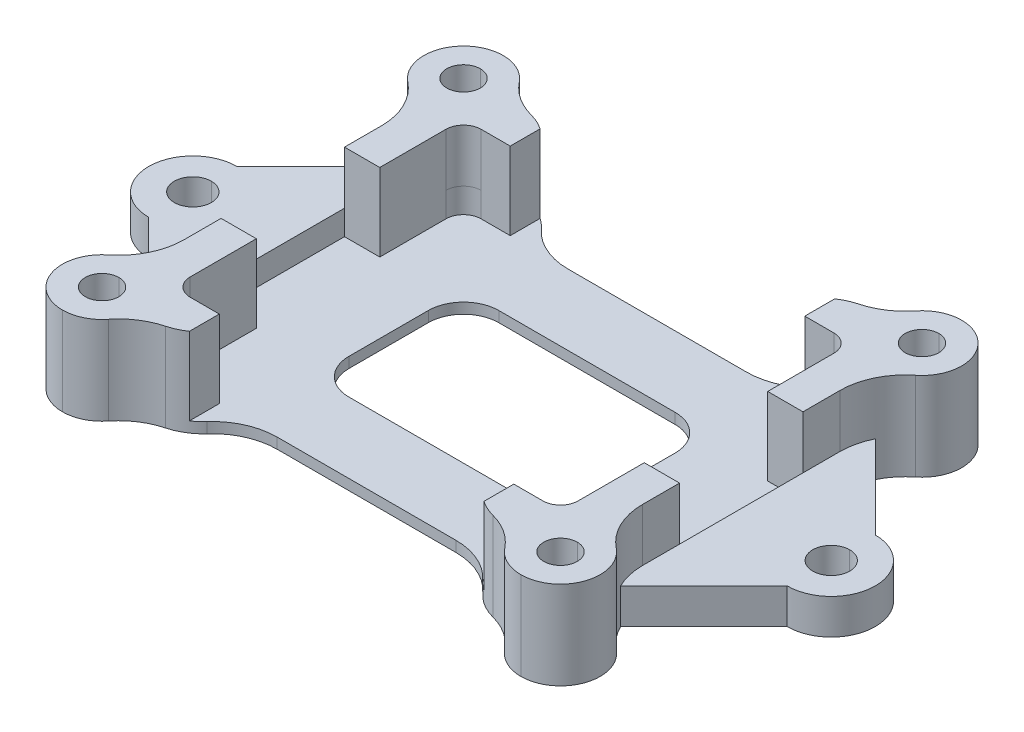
ISO-10303-21;
HEADER;
FILE_DESCRIPTION(('STEP AP214'),'2;1');
FILE_NAME('part.step','',(''),(''),'','','');
FILE_SCHEMA(('AUTOMOTIVE_DESIGN { 1 0 10303 214 1 1 1 1 }'));
ENDSEC;
DATA;
#1=APPLICATION_CONTEXT('core data for automotive mechanical design processes');
#2=APPLICATION_PROTOCOL_DEFINITION('international standard','automotive_design',2000,#1);
#3=PRODUCT_CONTEXT('',#1,'mechanical');
#4=PRODUCT('Part','Part','',(#3));
#5=PRODUCT_RELATED_PRODUCT_CATEGORY('part','',(#4));
#6=PRODUCT_DEFINITION_FORMATION('','',#4);
#7=PRODUCT_DEFINITION_CONTEXT('part definition',#1,'design');
#8=PRODUCT_DEFINITION('design','',#6,#7);
#9=PRODUCT_DEFINITION_SHAPE('','',#8);
#10=(LENGTH_UNIT() NAMED_UNIT(*) SI_UNIT(.MILLI.,.METRE.));
#11=(NAMED_UNIT(*) PLANE_ANGLE_UNIT() SI_UNIT($,.RADIAN.));
#12=(NAMED_UNIT(*) SI_UNIT($,.STERADIAN.) SOLID_ANGLE_UNIT());
#13=UNCERTAINTY_MEASURE_WITH_UNIT(LENGTH_MEASURE(1.E-05),#10,'distance_accuracy_value','');
#14=(GEOMETRIC_REPRESENTATION_CONTEXT(3) GLOBAL_UNCERTAINTY_ASSIGNED_CONTEXT((#13)) GLOBAL_UNIT_ASSIGNED_CONTEXT((#10,
#11,#12)) REPRESENTATION_CONTEXT('',''));
#15=CARTESIAN_POINT('',(0.,0.,0.));
#16=DIRECTION('',(0.,0.,1.));
#17=DIRECTION('',(1.,0.,0.));
#18=AXIS2_PLACEMENT_3D('',#15,#16,#17);
#19=CARTESIAN_POINT('',(-10.0488639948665,-6.9269119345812,-7.47148880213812));
#20=DIRECTION('',(0.,1.,0.));
#21=DIRECTION('',(0.,0.,1.));
#22=AXIS2_PLACEMENT_3D('',#19,#20,#21);
#23=CYLINDRICAL_SURFACE('',#22,3.);
#24=CARTESIAN_POINT('',(-10.0488639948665,0.,-7.47148880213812));
#25=DIRECTION('',(0.,-1.,0.));
#26=DIRECTION('',(0.,0.,1.));
#27=AXIS2_PLACEMENT_3D('',#24,#25,#26);
#28=CIRCLE('',#27,3.);
#29=CARTESIAN_POINT('',(-9.28384346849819,0.,-10.3723065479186));
#30=VERTEX_POINT('',#29);
#31=CARTESIAN_POINT('',(-7.81755097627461,0.,-9.47679232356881));
#32=VERTEX_POINT('',#31);
#33=EDGE_CURVE('E1063',#30,#32,#28,.T.);
#34=ORIENTED_EDGE('',*,*,#33,.F.);
#35=DIRECTION('',(0.,-1.,0.));
#36=VECTOR('',#35,1.);
#37=CARTESIAN_POINT('',(-9.28384346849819,-6.9269119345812,-10.3723065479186));
#38=LINE('',#37,#36);
#39=CARTESIAN_POINT('',(-9.28384346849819,5.,-10.3723065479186));
#40=VERTEX_POINT('',#39);
#41=EDGE_CURVE('E1451',#40,#30,#38,.T.);
#42=ORIENTED_EDGE('',*,*,#41,.F.);
#43=CARTESIAN_POINT('',(-10.0488639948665,5.,-7.47148880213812));
#44=DIRECTION('',(0.,1.,0.));
#45=DIRECTION('',(0.,0.,1.));
#46=AXIS2_PLACEMENT_3D('',#43,#44,#45);
#47=CIRCLE('',#46,3.);
#48=CARTESIAN_POINT('',(-8.35193359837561,5.,-9.94543852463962));
#49=VERTEX_POINT('',#48);
#50=EDGE_CURVE('E958',#49,#40,#47,.T.);
#51=ORIENTED_EDGE('',*,*,#50,.F.);
#52=DIRECTION('',(0.,1.,0.));
#53=VECTOR('',#52,1.);
#54=CARTESIAN_POINT('',(-8.35193359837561,0.6,-9.94543852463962));
#55=LINE('',#54,#53);
#56=CARTESIAN_POINT('',(-8.35193359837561,0.6,-9.94543852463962));
#57=VERTEX_POINT('',#56);
#58=EDGE_CURVE('E1088',#57,#49,#55,.T.);
#59=ORIENTED_EDGE('',*,*,#58,.F.);
#60=CARTESIAN_POINT('',(-10.0488639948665,0.6,-7.47148880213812));
#61=DIRECTION('',(0.,1.,0.));
#62=DIRECTION('',(0.,0.,1.));
#63=AXIS2_PLACEMENT_3D('',#60,#61,#62);
#64=CIRCLE('',#63,3.);
#65=CARTESIAN_POINT('',(-7.81755097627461,0.6,-9.47679232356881));
#66=VERTEX_POINT('',#65);
#67=EDGE_CURVE('E1439',#66,#57,#64,.T.);
#68=ORIENTED_EDGE('',*,*,#67,.F.);
#69=DIRECTION('',(0.,1.,0.));
#70=VECTOR('',#69,1.);
#71=CARTESIAN_POINT('',(-7.81755097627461,2.,-9.47679232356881));
#72=LINE('',#71,#70);
#73=EDGE_CURVE('E1454',#32,#66,#72,.T.);
#74=ORIENTED_EDGE('',*,*,#73,.F.);
#75=EDGE_LOOP('',(#34,#42,#51,#59,#68,#74));
#76=FACE_BOUND('',#75,.T.);
#77=ADVANCED_FACE('F15',(#76),#23,.T.);
#78=CARTESIAN_POINT('',(10.0488639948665,0.,-7.47148880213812));
#79=DIRECTION('',(0.,-1.,0.));
#80=DIRECTION('',(0.,0.,-1.));
#81=AXIS2_PLACEMENT_3D('',#78,#79,#80);
#82=CYLINDRICAL_SURFACE('',#81,3.);
#83=CARTESIAN_POINT('',(10.0488639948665,5.,-7.47148880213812));
#84=DIRECTION('',(0.,1.,0.));
#85=DIRECTION('',(0.,0.,1.));
#86=AXIS2_PLACEMENT_3D('',#83,#84,#85);
#87=CIRCLE('',#86,3.);
#88=CARTESIAN_POINT('',(9.28384346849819,5.,-10.3723065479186));
#89=VERTEX_POINT('',#88);
#90=CARTESIAN_POINT('',(8.35193359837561,5.,-9.94543852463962));
#91=VERTEX_POINT('',#90);
#92=EDGE_CURVE('E886',#89,#91,#87,.T.);
#93=ORIENTED_EDGE('',*,*,#92,.F.);
#94=DIRECTION('',(0.,1.,0.));
#95=VECTOR('',#94,1.);
#96=CARTESIAN_POINT('',(9.28384346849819,0.,-10.3723065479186));
#97=LINE('',#96,#95);
#98=CARTESIAN_POINT('',(9.28384346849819,0.,-10.3723065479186));
#99=VERTEX_POINT('',#98);
#100=EDGE_CURVE('E1554',#99,#89,#97,.T.);
#101=ORIENTED_EDGE('',*,*,#100,.F.);
#102=CARTESIAN_POINT('',(10.0488639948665,0.,-7.47148880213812));
#103=DIRECTION('',(0.,-1.,0.));
#104=DIRECTION('',(0.,0.,1.));
#105=AXIS2_PLACEMENT_3D('',#102,#103,#104);
#106=CIRCLE('',#105,3.);
#107=CARTESIAN_POINT('',(7.81755097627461,0.,-9.47679232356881));
#108=VERTEX_POINT('',#107);
#109=EDGE_CURVE('E1064',#108,#99,#106,.T.);
#110=ORIENTED_EDGE('',*,*,#109,.F.);
#111=DIRECTION('',(0.,-1.,0.));
#112=VECTOR('',#111,1.);
#113=CARTESIAN_POINT('',(7.81755097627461,2.,-9.47679232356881));
#114=LINE('',#113,#112);
#115=CARTESIAN_POINT('',(7.81755097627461,0.6,-9.47679232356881));
#116=VERTEX_POINT('',#115);
#117=EDGE_CURVE('E1455',#116,#108,#114,.T.);
#118=ORIENTED_EDGE('',*,*,#117,.F.);
#119=CARTESIAN_POINT('',(10.0488639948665,0.6,-7.47148880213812));
#120=DIRECTION('',(0.,1.,0.));
#121=DIRECTION('',(0.,0.,1.));
#122=AXIS2_PLACEMENT_3D('',#119,#120,#121);
#123=CIRCLE('',#122,3.);
#124=CARTESIAN_POINT('',(8.35193359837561,0.6,-9.94543852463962));
#125=VERTEX_POINT('',#124);
#126=EDGE_CURVE('E1005',#125,#116,#123,.T.);
#127=ORIENTED_EDGE('',*,*,#126,.F.);
#128=DIRECTION('',(0.,-1.,0.));
#129=VECTOR('',#128,1.);
#130=CARTESIAN_POINT('',(8.35193359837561,5.,-9.94543852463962));
#131=LINE('',#130,#129);
#132=EDGE_CURVE('E1092',#91,#125,#131,.T.);
#133=ORIENTED_EDGE('',*,*,#132,.F.);
#134=EDGE_LOOP('',(#93,#101,#110,#118,#127,#133));
#135=FACE_BOUND('',#134,.T.);
#136=ADVANCED_FACE('F1877',(#135),#82,.T.);
#137=CARTESIAN_POINT('',(-10.0488639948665,0.,7.47148880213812));
#138=DIRECTION('',(0.,-1.,0.));
#139=DIRECTION('',(0.,0.,-1.));
#140=AXIS2_PLACEMENT_3D('',#137,#138,#139);
#141=CYLINDRICAL_SURFACE('',#140,3.);
#142=CARTESIAN_POINT('',(-10.0488639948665,5.,7.47148880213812));
#143=DIRECTION('',(0.,1.,0.));
#144=DIRECTION('',(0.,0.,1.));
#145=AXIS2_PLACEMENT_3D('',#142,#143,#144);
#146=CIRCLE('',#145,3.);
#147=CARTESIAN_POINT('',(-9.28384346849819,5.,10.3723065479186));
#148=VERTEX_POINT('',#147);
#149=CARTESIAN_POINT('',(-8.35193359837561,5.,9.94543852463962));
#150=VERTEX_POINT('',#149);
#151=EDGE_CURVE('E923',#148,#150,#146,.T.);
#152=ORIENTED_EDGE('',*,*,#151,.F.);
#153=DIRECTION('',(0.,1.,0.));
#154=VECTOR('',#153,1.);
#155=CARTESIAN_POINT('',(-9.28384346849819,0.,10.3723065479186));
#156=LINE('',#155,#154);
#157=CARTESIAN_POINT('',(-9.28384346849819,0.,10.3723065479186));
#158=VERTEX_POINT('',#157);
#159=EDGE_CURVE('E23',#158,#148,#156,.T.);
#160=ORIENTED_EDGE('',*,*,#159,.F.);
#161=CARTESIAN_POINT('',(-10.0488639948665,0.,7.47148880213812));
#162=DIRECTION('',(0.,-1.,0.));
#163=DIRECTION('',(0.,0.,1.));
#164=AXIS2_PLACEMENT_3D('',#161,#162,#163);
#165=CIRCLE('',#164,3.);
#166=CARTESIAN_POINT('',(-7.81755097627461,0.,9.47679232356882));
#167=VERTEX_POINT('',#166);
#168=EDGE_CURVE('E781',#167,#158,#165,.T.);
#169=ORIENTED_EDGE('',*,*,#168,.F.);
#170=DIRECTION('',(0.,-1.,0.));
#171=VECTOR('',#170,1.);
#172=CARTESIAN_POINT('',(-7.81755097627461,2.,9.47679232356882));
#173=LINE('',#172,#171);
#174=CARTESIAN_POINT('',(-7.81755097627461,0.6,9.47679232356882));
#175=VERTEX_POINT('',#174);
#176=EDGE_CURVE('E10',#175,#167,#173,.T.);
#177=ORIENTED_EDGE('',*,*,#176,.F.);
#178=CARTESIAN_POINT('',(-10.0488639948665,0.6,7.47148880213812));
#179=DIRECTION('',(0.,1.,0.));
#180=DIRECTION('',(0.,0.,1.));
#181=AXIS2_PLACEMENT_3D('',#178,#179,#180);
#182=CIRCLE('',#181,3.);
#183=CARTESIAN_POINT('',(-8.35193359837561,0.6,9.94543852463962));
#184=VERTEX_POINT('',#183);
#185=EDGE_CURVE('E1466',#184,#175,#182,.T.);
#186=ORIENTED_EDGE('',*,*,#185,.F.);
#187=DIRECTION('',(0.,-1.,0.));
#188=VECTOR('',#187,1.);
#189=CARTESIAN_POINT('',(-8.35193359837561,5.,9.94543852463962));
#190=LINE('',#189,#188);
#191=EDGE_CURVE('E1529',#150,#184,#190,.T.);
#192=ORIENTED_EDGE('',*,*,#191,.F.);
#193=EDGE_LOOP('',(#152,#160,#169,#177,#186,#192));
#194=FACE_BOUND('',#193,.T.);
#195=ADVANCED_FACE('F1570',(#194),#141,.T.);
#196=CARTESIAN_POINT('',(10.0488639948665,-6.9269119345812,7.47148880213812));
#197=DIRECTION('',(0.,1.,0.));
#198=DIRECTION('',(0.,0.,1.));
#199=AXIS2_PLACEMENT_3D('',#196,#197,#198);
#200=CYLINDRICAL_SURFACE('',#199,3.);
#201=CARTESIAN_POINT('',(10.0488639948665,0.,7.47148880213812));
#202=DIRECTION('',(0.,-1.,0.));
#203=DIRECTION('',(0.,0.,1.));
#204=AXIS2_PLACEMENT_3D('',#201,#202,#203);
#205=CIRCLE('',#204,3.);
#206=CARTESIAN_POINT('',(9.28384346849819,0.,10.3723065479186));
#207=VERTEX_POINT('',#206);
#208=CARTESIAN_POINT('',(7.81755097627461,0.,9.47679232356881));
#209=VERTEX_POINT('',#208);
#210=EDGE_CURVE('E1026',#207,#209,#205,.T.);
#211=ORIENTED_EDGE('',*,*,#210,.F.);
#212=DIRECTION('',(0.,-1.,0.));
#213=VECTOR('',#212,1.);
#214=CARTESIAN_POINT('',(9.28384346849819,-6.9269119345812,10.3723065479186));
#215=LINE('',#214,#213);
#216=CARTESIAN_POINT('',(9.28384346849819,5.,10.3723065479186));
#217=VERTEX_POINT('',#216);
#218=EDGE_CURVE('E1548',#217,#207,#215,.T.);
#219=ORIENTED_EDGE('',*,*,#218,.F.);
#220=CARTESIAN_POINT('',(10.0488639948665,5.,7.47148880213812));
#221=DIRECTION('',(0.,1.,0.));
#222=DIRECTION('',(0.,0.,1.));
#223=AXIS2_PLACEMENT_3D('',#220,#221,#222);
#224=CIRCLE('',#223,3.);
#225=CARTESIAN_POINT('',(8.35193359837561,5.,9.94543852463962));
#226=VERTEX_POINT('',#225);
#227=EDGE_CURVE('E1315',#226,#217,#224,.T.);
#228=ORIENTED_EDGE('',*,*,#227,.F.);
#229=DIRECTION('',(0.,1.,0.));
#230=VECTOR('',#229,1.);
#231=CARTESIAN_POINT('',(8.35193359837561,0.6,9.94543852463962));
#232=LINE('',#231,#230);
#233=CARTESIAN_POINT('',(8.35193359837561,0.6,9.94543852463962));
#234=VERTEX_POINT('',#233);
#235=EDGE_CURVE('E1091',#234,#226,#232,.T.);
#236=ORIENTED_EDGE('',*,*,#235,.F.);
#237=CARTESIAN_POINT('',(10.0488639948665,0.6,7.47148880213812));
#238=DIRECTION('',(0.,1.,0.));
#239=DIRECTION('',(0.,0.,1.));
#240=AXIS2_PLACEMENT_3D('',#237,#238,#239);
#241=CIRCLE('',#240,3.);
#242=CARTESIAN_POINT('',(7.81755097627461,0.6,9.47679232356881));
#243=VERTEX_POINT('',#242);
#244=EDGE_CURVE('E1260',#243,#234,#241,.T.);
#245=ORIENTED_EDGE('',*,*,#244,.F.);
#246=DIRECTION('',(0.,1.,0.));
#247=VECTOR('',#246,1.);
#248=CARTESIAN_POINT('',(7.81755097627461,2.,9.47679232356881));
#249=LINE('',#248,#247);
#250=EDGE_CURVE('E1551',#209,#243,#249,.T.);
#251=ORIENTED_EDGE('',*,*,#250,.F.);
#252=EDGE_LOOP('',(#211,#219,#228,#236,#245,#251));
#253=FACE_BOUND('',#252,.T.);
#254=ADVANCED_FACE('F1920',(#253),#200,.T.);
#255=CARTESIAN_POINT('',(-16.7,-6.9269119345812,5.59033262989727));
#256=DIRECTION('',(0.,1.,0.));
#257=DIRECTION('',(0.,0.,1.));
#258=AXIS2_PLACEMENT_3D('',#255,#256,#257);
#259=CYLINDRICAL_SURFACE('',#258,3.7);
#260=CARTESIAN_POINT('',(-16.7,0.,5.59033262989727));
#261=DIRECTION('',(0.,1.,0.));
#262=DIRECTION('',(0.,0.,1.));
#263=AXIS2_PLACEMENT_3D('',#260,#261,#262);
#264=CIRCLE('',#263,3.7);
#265=CARTESIAN_POINT('',(-14.3991596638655,0.,8.48794091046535));
#266=VERTEX_POINT('',#265);
#267=CARTESIAN_POINT('',(-13.3794468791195,0.,7.22248671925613));
#268=VERTEX_POINT('',#267);
#269=EDGE_CURVE('E831',#266,#268,#264,.T.);
#270=ORIENTED_EDGE('',*,*,#269,.F.);
#271=DIRECTION('',(0.,-1.,0.));
#272=VECTOR('',#271,1.);
#273=CARTESIAN_POINT('',(-14.3991596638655,-6.9269119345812,8.48794091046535));
#274=LINE('',#273,#272);
#275=CARTESIAN_POINT('',(-14.3991596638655,5.,8.48794091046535));
#276=VERTEX_POINT('',#275);
#277=EDGE_CURVE('E1624',#276,#266,#274,.T.);
#278=ORIENTED_EDGE('',*,*,#277,.F.);
#279=CARTESIAN_POINT('',(-16.7,5.,5.59033262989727));
#280=DIRECTION('',(0.,-1.,0.));
#281=DIRECTION('',(0.,0.,1.));
#282=AXIS2_PLACEMENT_3D('',#279,#280,#281);
#283=CIRCLE('',#282,3.7);
#284=CARTESIAN_POINT('',(-13.,5.,5.59033262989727));
#285=VERTEX_POINT('',#284);
#286=EDGE_CURVE('E856',#285,#276,#283,.T.);
#287=ORIENTED_EDGE('',*,*,#286,.F.);
#288=DIRECTION('',(0.,1.,0.));
#289=VECTOR('',#288,1.);
#290=CARTESIAN_POINT('',(-13.,5.,5.59033262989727));
#291=LINE('',#290,#289);
#292=CARTESIAN_POINT('',(-13.,2.,5.59033262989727));
#293=VERTEX_POINT('',#292);
#294=EDGE_CURVE('E1293',#293,#285,#291,.T.);
#295=ORIENTED_EDGE('',*,*,#294,.F.);
#296=CARTESIAN_POINT('',(-16.7,2.,5.59033262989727));
#297=DIRECTION('',(0.,1.,0.));
#298=DIRECTION('',(0.,0.,1.));
#299=AXIS2_PLACEMENT_3D('',#296,#297,#298);
#300=CIRCLE('',#299,3.7);
#301=CARTESIAN_POINT('',(-13.3794468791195,2.,7.22248671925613));
#302=VERTEX_POINT('',#301);
#303=EDGE_CURVE('E1281',#302,#293,#300,.T.);
#304=ORIENTED_EDGE('',*,*,#303,.F.);
#305=DIRECTION('',(0.,1.,0.));
#306=VECTOR('',#305,1.);
#307=CARTESIAN_POINT('',(-13.3794468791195,0.,7.22248671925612));
#308=LINE('',#307,#306);
#309=EDGE_CURVE('E1209',#268,#302,#308,.T.);
#310=ORIENTED_EDGE('',*,*,#309,.F.);
#311=EDGE_LOOP('',(#270,#278,#287,#295,#304,#310));
#312=FACE_BOUND('',#311,.T.);
#313=ADVANCED_FACE('F1625',(#312),#259,.F.);
#314=CARTESIAN_POINT('',(-5.06559825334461,2.,11.95));
#315=DIRECTION('',(0.,-1.,0.));
#316=DIRECTION('',(0.,0.,-1.));
#317=AXIS2_PLACEMENT_3D('',#314,#315,#316);
#318=CYLINDRICAL_SURFACE('',#317,3.7);
#319=CARTESIAN_POINT('',(-5.06559825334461,0.6,11.95));
#320=DIRECTION('',(0.,-1.,0.));
#321=DIRECTION('',(0.,0.,1.));
#322=AXIS2_PLACEMENT_3D('',#319,#320,#321);
#323=CIRCLE('',#322,3.7);
#324=CARTESIAN_POINT('',(-5.06559825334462,0.6,8.25));
#325=VERTEX_POINT('',#324);
#326=EDGE_CURVE('E1470',#175,#325,#323,.T.);
#327=ORIENTED_EDGE('',*,*,#326,.F.);
#328=ORIENTED_EDGE('',*,*,#176,.T.);
#329=CARTESIAN_POINT('',(-5.06559825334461,0.,11.95));
#330=DIRECTION('',(0.,1.,0.));
#331=DIRECTION('',(0.,0.,1.));
#332=AXIS2_PLACEMENT_3D('',#329,#330,#331);
#333=CIRCLE('',#332,3.7);
#334=CARTESIAN_POINT('',(-5.06559825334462,0.,8.25));
#335=VERTEX_POINT('',#334);
#336=EDGE_CURVE('E786',#335,#167,#333,.T.);
#337=ORIENTED_EDGE('',*,*,#336,.F.);
#338=DIRECTION('',(0.,-1.,0.));
#339=VECTOR('',#338,1.);
#340=CARTESIAN_POINT('',(-5.06559825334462,0.,8.25));
#341=LINE('',#340,#339);
#342=EDGE_CURVE('E1545',#325,#335,#341,.T.);
#343=ORIENTED_EDGE('',*,*,#342,.F.);
#344=EDGE_LOOP('',(#327,#328,#337,#343));
#345=FACE_BOUND('',#344,.T.);
#346=ADVANCED_FACE('F1591',(#345),#318,.F.);
#347=CARTESIAN_POINT('',(-8.34031815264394,0.,13.9499817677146));
#348=DIRECTION('',(0.,-1.,0.));
#349=DIRECTION('',(0.,0.,-1.));
#350=AXIS2_PLACEMENT_3D('',#347,#348,#349);
#351=CYLINDRICAL_SURFACE('',#350,3.7);
#352=CARTESIAN_POINT('',(-8.34031815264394,0.,13.9499817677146));
#353=DIRECTION('',(0.,1.,0.));
#354=DIRECTION('',(0.,0.,1.));
#355=AXIS2_PLACEMENT_3D('',#352,#353,#354);
#356=CIRCLE('',#355,3.7);
#357=CARTESIAN_POINT('',(-11.2379354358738,0.,11.6491527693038));
#358=VERTEX_POINT('',#357);
#359=EDGE_CURVE('E785',#158,#358,#356,.T.);
#360=ORIENTED_EDGE('',*,*,#359,.F.);
#361=ORIENTED_EDGE('',*,*,#159,.T.);
#362=CARTESIAN_POINT('',(-8.34031815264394,5.,13.9499817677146));
#363=DIRECTION('',(0.,-1.,0.));
#364=DIRECTION('',(0.,0.,1.));
#365=AXIS2_PLACEMENT_3D('',#362,#363,#364);
#366=CIRCLE('',#365,3.7);
#367=CARTESIAN_POINT('',(-11.2379354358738,5.,11.6491527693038));
#368=VERTEX_POINT('',#367);
#369=EDGE_CURVE('E1141',#368,#148,#366,.T.);
#370=ORIENTED_EDGE('',*,*,#369,.F.);
#371=DIRECTION('',(0.,1.,0.));
#372=VECTOR('',#371,1.);
#373=CARTESIAN_POINT('',(-11.2379354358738,-6.9269119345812,11.6491527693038));
#374=LINE('',#373,#372);
#375=EDGE_CURVE('E1201',#358,#368,#374,.T.);
#376=ORIENTED_EDGE('',*,*,#375,.F.);
#377=EDGE_LOOP('',(#360,#361,#370,#376));
#378=FACE_BOUND('',#377,.T.);
#379=ADVANCED_FACE('F1567',(#378),#351,.F.);
#380=CARTESIAN_POINT('',(-16.7,-6.9269119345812,-5.59033262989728));
#381=DIRECTION('',(0.,1.,0.));
#382=DIRECTION('',(0.,0.,1.));
#383=AXIS2_PLACEMENT_3D('',#380,#381,#382);
#384=CYLINDRICAL_SURFACE('',#383,3.7);
#385=CARTESIAN_POINT('',(-16.7,2.,-5.59033262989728));
#386=DIRECTION('',(0.,1.,0.));
#387=DIRECTION('',(0.,0.,1.));
#388=AXIS2_PLACEMENT_3D('',#385,#386,#387);
#389=CIRCLE('',#388,3.7);
#390=CARTESIAN_POINT('',(-13.,2.,-5.59033262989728));
#391=VERTEX_POINT('',#390);
#392=CARTESIAN_POINT('',(-13.3794468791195,2.,-7.22248671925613));
#393=VERTEX_POINT('',#392);
#394=EDGE_CURVE('E1188',#391,#393,#389,.T.);
#395=ORIENTED_EDGE('',*,*,#394,.F.);
#396=DIRECTION('',(0.,-1.,0.));
#397=VECTOR('',#396,1.);
#398=CARTESIAN_POINT('',(-13.,5.,-5.59033262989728));
#399=LINE('',#398,#397);
#400=CARTESIAN_POINT('',(-13.,5.,-5.59033262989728));
#401=VERTEX_POINT('',#400);
#402=EDGE_CURVE('E876',#401,#391,#399,.T.);
#403=ORIENTED_EDGE('',*,*,#402,.F.);
#404=CARTESIAN_POINT('',(-16.7,5.,-5.59033262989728));
#405=DIRECTION('',(0.,-1.,0.));
#406=DIRECTION('',(0.,0.,1.));
#407=AXIS2_PLACEMENT_3D('',#404,#405,#406);
#408=CIRCLE('',#407,3.7);
#409=CARTESIAN_POINT('',(-14.3991596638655,5.,-8.48794091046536));
#410=VERTEX_POINT('',#409);
#411=EDGE_CURVE('E1161',#410,#401,#408,.T.);
#412=ORIENTED_EDGE('',*,*,#411,.F.);
#413=DIRECTION('',(0.,1.,0.));
#414=VECTOR('',#413,1.);
#415=CARTESIAN_POINT('',(-14.3991596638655,-6.9269119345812,-8.48794091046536));
#416=LINE('',#415,#414);
#417=CARTESIAN_POINT('',(-14.3991596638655,0.,-8.48794091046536));
#418=VERTEX_POINT('',#417);
#419=EDGE_CURVE('E755',#418,#410,#416,.T.);
#420=ORIENTED_EDGE('',*,*,#419,.F.);
#421=CARTESIAN_POINT('',(-16.7,0.,-5.59033262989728));
#422=DIRECTION('',(0.,1.,0.));
#423=DIRECTION('',(0.,0.,1.));
#424=AXIS2_PLACEMENT_3D('',#421,#422,#423);
#425=CIRCLE('',#424,3.7);
#426=CARTESIAN_POINT('',(-13.3794468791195,0.,-7.22248671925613));
#427=VERTEX_POINT('',#426);
#428=EDGE_CURVE('E1053',#427,#418,#425,.T.);
#429=ORIENTED_EDGE('',*,*,#428,.F.);
#430=DIRECTION('',(0.,-1.,0.));
#431=VECTOR('',#430,1.);
#432=CARTESIAN_POINT('',(-13.3794468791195,2.,-7.22248671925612));
#433=LINE('',#432,#431);
#434=EDGE_CURVE('E753',#393,#427,#433,.T.);
#435=ORIENTED_EDGE('',*,*,#434,.F.);
#436=EDGE_LOOP('',(#395,#403,#412,#420,#429,#435));
#437=FACE_BOUND('',#436,.T.);
#438=ADVANCED_FACE('F1714',(#437),#384,.F.);
#439=CARTESIAN_POINT('',(-5.06559825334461,2.,-11.95));
#440=DIRECTION('',(0.,1.,0.));
#441=DIRECTION('',(0.,0.,1.));
#442=AXIS2_PLACEMENT_3D('',#439,#440,#441);
#443=CYLINDRICAL_SURFACE('',#442,3.7);
#444=CARTESIAN_POINT('',(-5.06559825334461,0.,-11.95));
#445=DIRECTION('',(0.,1.,0.));
#446=DIRECTION('',(0.,0.,1.));
#447=AXIS2_PLACEMENT_3D('',#444,#445,#446);
#448=CIRCLE('',#447,3.7);
#449=CARTESIAN_POINT('',(-5.06559825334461,0.,-8.25));
#450=VERTEX_POINT('',#449);
#451=EDGE_CURVE('E1058',#32,#450,#448,.T.);
#452=ORIENTED_EDGE('',*,*,#451,.F.);
#453=ORIENTED_EDGE('',*,*,#73,.T.);
#454=CARTESIAN_POINT('',(-5.06559825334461,0.6,-11.95));
#455=DIRECTION('',(0.,-1.,0.));
#456=DIRECTION('',(0.,0.,1.));
#457=AXIS2_PLACEMENT_3D('',#454,#455,#456);
#458=CIRCLE('',#457,3.7);
#459=CARTESIAN_POINT('',(-5.06559825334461,0.6,-8.25));
#460=VERTEX_POINT('',#459);
#461=EDGE_CURVE('E1435',#460,#66,#458,.T.);
#462=ORIENTED_EDGE('',*,*,#461,.F.);
#463=DIRECTION('',(0.,1.,0.));
#464=VECTOR('',#463,1.);
#465=CARTESIAN_POINT('',(-5.06559825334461,0.,-8.25));
#466=LINE('',#465,#464);
#467=EDGE_CURVE('E1282',#450,#460,#466,.T.);
#468=ORIENTED_EDGE('',*,*,#467,.F.);
#469=EDGE_LOOP('',(#452,#453,#462,#468));
#470=FACE_BOUND('',#469,.T.);
#471=ADVANCED_FACE('F1864',(#470),#443,.F.);
#472=CARTESIAN_POINT('',(-8.34031815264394,-6.9269119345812,-13.9499817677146));
#473=DIRECTION('',(0.,-1.,0.));
#474=DIRECTION('',(0.,0.,-1.));
#475=AXIS2_PLACEMENT_3D('',#472,#473,#474);
#476=CYLINDRICAL_SURFACE('',#475,3.7);
#477=CARTESIAN_POINT('',(-8.34031815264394,5.,-13.9499817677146));
#478=DIRECTION('',(0.,-1.,0.));
#479=DIRECTION('',(0.,0.,1.));
#480=AXIS2_PLACEMENT_3D('',#477,#478,#479);
#481=CIRCLE('',#480,3.7);
#482=CARTESIAN_POINT('',(-11.2379354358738,5.,-11.6491527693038));
#483=VERTEX_POINT('',#482);
#484=EDGE_CURVE('E995',#40,#483,#481,.T.);
#485=ORIENTED_EDGE('',*,*,#484,.F.);
#486=ORIENTED_EDGE('',*,*,#41,.T.);
#487=CARTESIAN_POINT('',(-8.34031815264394,0.,-13.9499817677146));
#488=DIRECTION('',(0.,1.,0.));
#489=DIRECTION('',(0.,0.,1.));
#490=AXIS2_PLACEMENT_3D('',#487,#488,#489);
#491=CIRCLE('',#490,3.7);
#492=CARTESIAN_POINT('',(-11.2379354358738,0.,-11.6491527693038));
#493=VERTEX_POINT('',#492);
#494=EDGE_CURVE('E1073',#493,#30,#491,.T.);
#495=ORIENTED_EDGE('',*,*,#494,.F.);
#496=DIRECTION('',(0.,-1.,0.));
#497=VECTOR('',#496,1.);
#498=CARTESIAN_POINT('',(-11.2379354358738,-6.9269119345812,-11.6491527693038));
#499=LINE('',#498,#497);
#500=EDGE_CURVE('E759',#483,#493,#499,.T.);
#501=ORIENTED_EDGE('',*,*,#500,.F.);
#502=EDGE_LOOP('',(#485,#486,#495,#501));
#503=FACE_BOUND('',#502,.T.);
#504=ADVANCED_FACE('F1856',(#503),#476,.F.);
#505=CARTESIAN_POINT('',(16.7,-6.9269119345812,-5.59033262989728));
#506=DIRECTION('',(0.,1.,0.));
#507=DIRECTION('',(0.,0.,1.));
#508=AXIS2_PLACEMENT_3D('',#505,#506,#507);
#509=CYLINDRICAL_SURFACE('',#508,3.7);
#510=CARTESIAN_POINT('',(16.7,0.,-5.59033262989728));
#511=DIRECTION('',(0.,1.,0.));
#512=DIRECTION('',(0.,0.,1.));
#513=AXIS2_PLACEMENT_3D('',#510,#511,#512);
#514=CIRCLE('',#513,3.7);
#515=CARTESIAN_POINT('',(14.3991596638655,0.,-8.48794091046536));
#516=VERTEX_POINT('',#515);
#517=CARTESIAN_POINT('',(13.3794468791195,0.,-7.22248671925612));
#518=VERTEX_POINT('',#517);
#519=EDGE_CURVE('E1036',#516,#518,#514,.T.);
#520=ORIENTED_EDGE('',*,*,#519,.F.);
#521=DIRECTION('',(0.,-1.,0.));
#522=VECTOR('',#521,1.);
#523=CARTESIAN_POINT('',(14.3991596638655,-6.9269119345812,-8.48794091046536));
#524=LINE('',#523,#522);
#525=CARTESIAN_POINT('',(14.3991596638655,5.,-8.48794091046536));
#526=VERTEX_POINT('',#525);
#527=EDGE_CURVE('E1536',#526,#516,#524,.T.);
#528=ORIENTED_EDGE('',*,*,#527,.F.);
#529=CARTESIAN_POINT('',(16.7,5.,-5.59033262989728));
#530=DIRECTION('',(0.,-1.,0.));
#531=DIRECTION('',(0.,0.,1.));
#532=AXIS2_PLACEMENT_3D('',#529,#530,#531);
#533=CIRCLE('',#532,3.7);
#534=CARTESIAN_POINT('',(13.,5.,-5.59033262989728));
#535=VERTEX_POINT('',#534);
#536=EDGE_CURVE('E795',#535,#526,#533,.T.);
#537=ORIENTED_EDGE('',*,*,#536,.F.);
#538=DIRECTION('',(0.,1.,0.));
#539=VECTOR('',#538,1.);
#540=CARTESIAN_POINT('',(13.,5.,-5.59033262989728));
#541=LINE('',#540,#539);
#542=CARTESIAN_POINT('',(13.,2.,-5.59033262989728));
#543=VERTEX_POINT('',#542);
#544=EDGE_CURVE('E770',#543,#535,#541,.T.);
#545=ORIENTED_EDGE('',*,*,#544,.F.);
#546=CARTESIAN_POINT('',(16.7,2.,-5.59033262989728));
#547=DIRECTION('',(0.,1.,0.));
#548=DIRECTION('',(0.,0.,1.));
#549=AXIS2_PLACEMENT_3D('',#546,#547,#548);
#550=CIRCLE('',#549,3.7);
#551=CARTESIAN_POINT('',(13.3794468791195,2.,-7.22248671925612));
#552=VERTEX_POINT('',#551);
#553=EDGE_CURVE('E1259',#552,#543,#550,.T.);
#554=ORIENTED_EDGE('',*,*,#553,.F.);
#555=DIRECTION('',(0.,1.,0.));
#556=VECTOR('',#555,1.);
#557=CARTESIAN_POINT('',(13.3794468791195,0.,-7.22248671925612));
#558=LINE('',#557,#556);
#559=EDGE_CURVE('E973',#518,#552,#558,.T.);
#560=ORIENTED_EDGE('',*,*,#559,.F.);
#561=EDGE_LOOP('',(#520,#528,#537,#545,#554,#560));
#562=FACE_BOUND('',#561,.T.);
#563=ADVANCED_FACE('F1891',(#562),#509,.F.);
#564=CARTESIAN_POINT('',(5.06559825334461,2.,-11.95));
#565=DIRECTION('',(0.,-1.,0.));
#566=DIRECTION('',(0.,0.,-1.));
#567=AXIS2_PLACEMENT_3D('',#564,#565,#566);
#568=CYLINDRICAL_SURFACE('',#567,3.7);
#569=CARTESIAN_POINT('',(5.06559825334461,0.6,-11.95));
#570=DIRECTION('',(0.,-1.,0.));
#571=DIRECTION('',(0.,0.,1.));
#572=AXIS2_PLACEMENT_3D('',#569,#570,#571);
#573=CIRCLE('',#572,3.7);
#574=CARTESIAN_POINT('',(5.06559825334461,0.6,-8.25));
#575=VERTEX_POINT('',#574);
#576=EDGE_CURVE('E1000',#116,#575,#573,.T.);
#577=ORIENTED_EDGE('',*,*,#576,.F.);
#578=ORIENTED_EDGE('',*,*,#117,.T.);
#579=CARTESIAN_POINT('',(5.06559825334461,0.,-11.95));
#580=DIRECTION('',(0.,1.,0.));
#581=DIRECTION('',(0.,0.,1.));
#582=AXIS2_PLACEMENT_3D('',#579,#580,#581);
#583=CIRCLE('',#582,3.7);
#584=CARTESIAN_POINT('',(5.06559825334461,0.,-8.25));
#585=VERTEX_POINT('',#584);
#586=EDGE_CURVE('E1069',#585,#108,#583,.T.);
#587=ORIENTED_EDGE('',*,*,#586,.F.);
#588=DIRECTION('',(0.,-1.,0.));
#589=VECTOR('',#588,1.);
#590=CARTESIAN_POINT('',(5.06559825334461,0.,-8.25));
#591=LINE('',#590,#589);
#592=EDGE_CURVE('E1204',#575,#585,#591,.T.);
#593=ORIENTED_EDGE('',*,*,#592,.F.);
#594=EDGE_LOOP('',(#577,#578,#587,#593));
#595=FACE_BOUND('',#594,.T.);
#596=ADVANCED_FACE('F1872',(#595),#568,.F.);
#597=CARTESIAN_POINT('',(8.34031815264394,0.,-13.9499817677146));
#598=DIRECTION('',(0.,-1.,0.));
#599=DIRECTION('',(0.,0.,-1.));
#600=AXIS2_PLACEMENT_3D('',#597,#598,#599);
#601=CYLINDRICAL_SURFACE('',#600,3.7);
#602=CARTESIAN_POINT('',(8.34031815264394,0.,-13.9499817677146));
#603=DIRECTION('',(0.,1.,0.));
#604=DIRECTION('',(0.,0.,1.));
#605=AXIS2_PLACEMENT_3D('',#602,#603,#604);
#606=CIRCLE('',#605,3.7);
#607=CARTESIAN_POINT('',(11.2379354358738,0.,-11.6491527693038));
#608=VERTEX_POINT('',#607);
#609=EDGE_CURVE('E1068',#99,#608,#606,.T.);
#610=ORIENTED_EDGE('',*,*,#609,.F.);
#611=ORIENTED_EDGE('',*,*,#100,.T.);
#612=CARTESIAN_POINT('',(8.34031815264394,5.,-13.9499817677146));
#613=DIRECTION('',(0.,-1.,0.));
#614=DIRECTION('',(0.,0.,1.));
#615=AXIS2_PLACEMENT_3D('',#612,#613,#614);
#616=CIRCLE('',#615,3.7);
#617=CARTESIAN_POINT('',(11.2379354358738,5.,-11.6491527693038));
#618=VERTEX_POINT('',#617);
#619=EDGE_CURVE('E882',#618,#89,#616,.T.);
#620=ORIENTED_EDGE('',*,*,#619,.F.);
#621=DIRECTION('',(0.,1.,0.));
#622=VECTOR('',#621,1.);
#623=CARTESIAN_POINT('',(11.2379354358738,-6.9269119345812,-11.6491527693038));
#624=LINE('',#623,#622);
#625=EDGE_CURVE('E758',#608,#618,#624,.T.);
#626=ORIENTED_EDGE('',*,*,#625,.F.);
#627=EDGE_LOOP('',(#610,#611,#620,#626));
#628=FACE_BOUND('',#627,.T.);
#629=ADVANCED_FACE('F1881',(#628),#601,.F.);
#630=CARTESIAN_POINT('',(16.7,-6.9269119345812,5.59033262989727));
#631=DIRECTION('',(0.,1.,0.));
#632=DIRECTION('',(0.,0.,1.));
#633=AXIS2_PLACEMENT_3D('',#630,#631,#632);
#634=CYLINDRICAL_SURFACE('',#633,3.7);
#635=CARTESIAN_POINT('',(16.7,2.,5.59033262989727));
#636=DIRECTION('',(0.,1.,0.));
#637=DIRECTION('',(0.,0.,1.));
#638=AXIS2_PLACEMENT_3D('',#635,#636,#637);
#639=CIRCLE('',#638,3.7);
#640=CARTESIAN_POINT('',(13.,2.,5.59033262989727));
#641=VERTEX_POINT('',#640);
#642=CARTESIAN_POINT('',(13.3794468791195,2.,7.22248671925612));
#643=VERTEX_POINT('',#642);
#644=EDGE_CURVE('E1248',#641,#643,#639,.T.);
#645=ORIENTED_EDGE('',*,*,#644,.F.);
#646=DIRECTION('',(0.,-1.,0.));
#647=VECTOR('',#646,1.);
#648=CARTESIAN_POINT('',(13.,5.,5.59033262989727));
#649=LINE('',#648,#647);
#650=CARTESIAN_POINT('',(13.,5.,5.59033262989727));
#651=VERTEX_POINT('',#650);
#652=EDGE_CURVE('E722',#651,#641,#649,.T.);
#653=ORIENTED_EDGE('',*,*,#652,.F.);
#654=CARTESIAN_POINT('',(16.7,5.,5.59033262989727));
#655=DIRECTION('',(0.,-1.,0.));
#656=DIRECTION('',(0.,0.,1.));
#657=AXIS2_PLACEMENT_3D('',#654,#655,#656);
#658=CIRCLE('',#657,3.7);
#659=CARTESIAN_POINT('',(14.3991596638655,5.,8.48794091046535));
#660=VERTEX_POINT('',#659);
#661=EDGE_CURVE('E1326',#660,#651,#658,.T.);
#662=ORIENTED_EDGE('',*,*,#661,.F.);
#663=DIRECTION('',(0.,1.,0.));
#664=VECTOR('',#663,1.);
#665=CARTESIAN_POINT('',(14.3991596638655,-6.9269119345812,8.48794091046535));
#666=LINE('',#665,#664);
#667=CARTESIAN_POINT('',(14.3991596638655,0.,8.48794091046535));
#668=VERTEX_POINT('',#667);
#669=EDGE_CURVE('E1205',#668,#660,#666,.T.);
#670=ORIENTED_EDGE('',*,*,#669,.F.);
#671=CARTESIAN_POINT('',(16.7,0.,5.59033262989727));
#672=DIRECTION('',(0.,1.,0.));
#673=DIRECTION('',(0.,0.,1.));
#674=AXIS2_PLACEMENT_3D('',#671,#672,#673);
#675=CIRCLE('',#674,3.7);
#676=CARTESIAN_POINT('',(13.3794468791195,0.,7.22248671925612));
#677=VERTEX_POINT('',#676);
#678=EDGE_CURVE('E942',#677,#668,#675,.T.);
#679=ORIENTED_EDGE('',*,*,#678,.F.);
#680=DIRECTION('',(0.,-1.,0.));
#681=VECTOR('',#680,1.);
#682=CARTESIAN_POINT('',(13.3794468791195,2.,7.22248671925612));
#683=LINE('',#682,#681);
#684=EDGE_CURVE('E1305',#643,#677,#683,.T.);
#685=ORIENTED_EDGE('',*,*,#684,.F.);
#686=EDGE_LOOP('',(#645,#653,#662,#670,#679,#685));
#687=FACE_BOUND('',#686,.T.);
#688=ADVANCED_FACE('F1907',(#687),#634,.F.);
#689=CARTESIAN_POINT('',(5.06559825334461,2.,11.95));
#690=DIRECTION('',(0.,1.,0.));
#691=DIRECTION('',(0.,0.,1.));
#692=AXIS2_PLACEMENT_3D('',#689,#690,#691);
#693=CYLINDRICAL_SURFACE('',#692,3.7);
#694=CARTESIAN_POINT('',(5.06559825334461,0.,11.95));
#695=DIRECTION('',(0.,1.,0.));
#696=DIRECTION('',(0.,0.,1.));
#697=AXIS2_PLACEMENT_3D('',#694,#695,#696);
#698=CIRCLE('',#697,3.7);
#699=CARTESIAN_POINT('',(5.06559825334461,0.,8.25));
#700=VERTEX_POINT('',#699);
#701=EDGE_CURVE('E1030',#209,#700,#698,.T.);
#702=ORIENTED_EDGE('',*,*,#701,.F.);
#703=ORIENTED_EDGE('',*,*,#250,.T.);
#704=CARTESIAN_POINT('',(5.06559825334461,0.6,11.95));
#705=DIRECTION('',(0.,-1.,0.));
#706=DIRECTION('',(0.,0.,1.));
#707=AXIS2_PLACEMENT_3D('',#704,#705,#706);
#708=CIRCLE('',#707,3.7);
#709=CARTESIAN_POINT('',(5.06559825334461,0.6,8.25));
#710=VERTEX_POINT('',#709);
#711=EDGE_CURVE('E1265',#710,#243,#708,.T.);
#712=ORIENTED_EDGE('',*,*,#711,.F.);
#713=DIRECTION('',(0.,1.,0.));
#714=VECTOR('',#713,1.);
#715=CARTESIAN_POINT('',(5.06559825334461,0.,8.25));
#716=LINE('',#715,#714);
#717=EDGE_CURVE('E1285',#700,#710,#716,.T.);
#718=ORIENTED_EDGE('',*,*,#717,.F.);
#719=EDGE_LOOP('',(#702,#703,#712,#718));
#720=FACE_BOUND('',#719,.T.);
#721=ADVANCED_FACE('F1925',(#720),#693,.F.);
#722=CARTESIAN_POINT('',(8.34031815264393,-6.9269119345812,13.9499817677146));
#723=DIRECTION('',(0.,-1.,0.));
#724=DIRECTION('',(0.,0.,-1.));
#725=AXIS2_PLACEMENT_3D('',#722,#723,#724);
#726=CYLINDRICAL_SURFACE('',#725,3.7);
#727=CARTESIAN_POINT('',(8.34031815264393,5.,13.9499817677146));
#728=DIRECTION('',(0.,-1.,0.));
#729=DIRECTION('',(0.,0.,1.));
#730=AXIS2_PLACEMENT_3D('',#727,#728,#729);
#731=CIRCLE('',#730,3.7);
#732=CARTESIAN_POINT('',(11.2379354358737,5.,11.6491527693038));
#733=VERTEX_POINT('',#732);
#734=EDGE_CURVE('E1319',#217,#733,#731,.T.);
#735=ORIENTED_EDGE('',*,*,#734,.F.);
#736=ORIENTED_EDGE('',*,*,#218,.T.);
#737=CARTESIAN_POINT('',(8.34031815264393,0.,13.9499817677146));
#738=DIRECTION('',(0.,1.,0.));
#739=DIRECTION('',(0.,0.,1.));
#740=AXIS2_PLACEMENT_3D('',#737,#738,#739);
#741=CIRCLE('',#740,3.7);
#742=CARTESIAN_POINT('',(11.2379354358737,0.,11.6491527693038));
#743=VERTEX_POINT('',#742);
#744=EDGE_CURVE('E1015',#743,#207,#741,.T.);
#745=ORIENTED_EDGE('',*,*,#744,.F.);
#746=DIRECTION('',(0.,-1.,0.));
#747=VECTOR('',#746,1.);
#748=CARTESIAN_POINT('',(11.2379354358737,-6.9269119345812,11.6491527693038));
#749=LINE('',#748,#747);
#750=EDGE_CURVE('E764',#733,#743,#749,.T.);
#751=ORIENTED_EDGE('',*,*,#750,.F.);
#752=EDGE_LOOP('',(#735,#736,#745,#751));
#753=FACE_BOUND('',#752,.T.);
#754=ADVANCED_FACE('F1916',(#753),#726,.F.);
#755=CARTESIAN_POINT('',(-8.3519335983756,0.,8.25));
#756=DIRECTION('',(0.,0.,-1.));
#757=DIRECTION('',(-1.,0.,0.));
#758=AXIS2_PLACEMENT_3D('',#755,#756,#757);
#759=PLANE('',#758);
#760=DIRECTION('',(-1.,0.,0.));
#761=VECTOR('',#760,1.);
#762=CARTESIAN_POINT('',(-8.3519335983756,0.,8.25));
#763=LINE('',#762,#761);
#764=EDGE_CURVE('E1022',#700,#335,#763,.T.);
#765=ORIENTED_EDGE('',*,*,#764,.F.);
#766=ORIENTED_EDGE('',*,*,#717,.T.);
#767=DIRECTION('',(-1.,0.,0.));
#768=VECTOR('',#767,1.);
#769=CARTESIAN_POINT('',(0.,0.6,8.25));
#770=LINE('',#769,#768);
#771=EDGE_CURVE('E1474',#710,#325,#770,.T.);
#772=ORIENTED_EDGE('',*,*,#771,.T.);
#773=ORIENTED_EDGE('',*,*,#342,.T.);
#774=EDGE_LOOP('',(#765,#766,#772,#773));
#775=FACE_BOUND('',#774,.T.);
#776=ADVANCED_FACE('F1928',(#775),#759,.F.);
#777=CARTESIAN_POINT('',(-8.35193359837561,0.,-8.25));
#778=DIRECTION('',(0.,0.,1.));
#779=DIRECTION('',(1.,0.,0.));
#780=AXIS2_PLACEMENT_3D('',#777,#778,#779);
#781=PLANE('',#780);
#782=DIRECTION('',(1.,0.,0.));
#783=VECTOR('',#782,1.);
#784=CARTESIAN_POINT('',(0.,0.6,-8.25));
#785=LINE('',#784,#783);
#786=EDGE_CURVE('E1004',#460,#575,#785,.T.);
#787=ORIENTED_EDGE('',*,*,#786,.T.);
#788=ORIENTED_EDGE('',*,*,#592,.T.);
#789=DIRECTION('',(1.,0.,0.));
#790=VECTOR('',#789,1.);
#791=CARTESIAN_POINT('',(-8.35193359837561,0.,-8.25));
#792=LINE('',#791,#790);
#793=EDGE_CURVE('E1062',#450,#585,#792,.T.);
#794=ORIENTED_EDGE('',*,*,#793,.F.);
#795=ORIENTED_EDGE('',*,*,#467,.T.);
#796=EDGE_LOOP('',(#787,#788,#794,#795));
#797=FACE_BOUND('',#796,.T.);
#798=ADVANCED_FACE('F1868',(#797),#781,.F.);
#799=CARTESIAN_POINT('',(-13.,-6.9269119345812,10.25));
#800=DIRECTION('',(0.,1.,0.));
#801=DIRECTION('',(0.,0.,1.));
#802=AXIS2_PLACEMENT_3D('',#799,#800,#801);
#803=CYLINDRICAL_SURFACE('',#802,0.94999999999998);
#804=DIRECTION('',(0.,1.,0.));
#805=VECTOR('',#804,1.);
#806=CARTESIAN_POINT('',(-13.,-6.9269119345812,9.3));
#807=LINE('',#806,#805);
#808=CARTESIAN_POINT('',(-13.,0.,9.3));
#809=VERTEX_POINT('',#808);
#810=CARTESIAN_POINT('',(-13.,5.,9.3));
#811=VERTEX_POINT('',#810);
#812=EDGE_CURVE('E1791',#809,#811,#807,.T.);
#813=ORIENTED_EDGE('',*,*,#812,.F.);
#814=CARTESIAN_POINT('',(-13.,0.,10.25));
#815=DIRECTION('',(0.,-1.,0.));
#816=DIRECTION('',(0.,0.,1.));
#817=AXIS2_PLACEMENT_3D('',#814,#815,#816);
#818=CIRCLE('',#817,0.94999999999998);
#819=CARTESIAN_POINT('',(-13.,0.,11.2));
#820=VERTEX_POINT('',#819);
#821=EDGE_CURVE('E959',#809,#820,#818,.T.);
#822=ORIENTED_EDGE('',*,*,#821,.T.);
#823=DIRECTION('',(0.,1.,0.));
#824=VECTOR('',#823,1.);
#825=CARTESIAN_POINT('',(-13.,-6.9269119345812,11.2));
#826=LINE('',#825,#824);
#827=CARTESIAN_POINT('',(-13.,5.,11.2));
#828=VERTEX_POINT('',#827);
#829=EDGE_CURVE('E1670',#820,#828,#826,.T.);
#830=ORIENTED_EDGE('',*,*,#829,.T.);
#831=CARTESIAN_POINT('',(-13.,5.,10.25));
#832=DIRECTION('',(0.,1.,0.));
#833=DIRECTION('',(0.,0.,-1.));
#834=AXIS2_PLACEMENT_3D('',#831,#832,#833);
#835=CIRCLE('',#834,0.94999999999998);
#836=EDGE_CURVE('E887',#828,#811,#835,.T.);
#837=ORIENTED_EDGE('',*,*,#836,.T.);
#838=EDGE_LOOP('',(#813,#822,#830,#837));
#839=FACE_BOUND('',#838,.T.);
#840=ADVANCED_FACE('F2391',(#839),#803,.F.);
#841=CARTESIAN_POINT('',(-13.,-6.9269119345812,10.25));
#842=DIRECTION('',(0.,1.,0.));
#843=DIRECTION('',(0.,0.,1.));
#844=AXIS2_PLACEMENT_3D('',#841,#842,#843);
#845=CYLINDRICAL_SURFACE('',#844,2.25);
#846=DIRECTION('',(0.,1.,0.));
#847=VECTOR('',#846,1.);
#848=CARTESIAN_POINT('',(-13.,-6.9269119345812,12.5));
#849=LINE('',#848,#847);
#850=CARTESIAN_POINT('',(-13.,0.,12.5));
#851=VERTEX_POINT('',#850);
#852=CARTESIAN_POINT('',(-13.,5.,12.5));
#853=VERTEX_POINT('',#852);
#854=EDGE_CURVE('E1582',#851,#853,#849,.T.);
#855=ORIENTED_EDGE('',*,*,#854,.F.);
#856=CARTESIAN_POINT('',(-13.,0.,10.25));
#857=DIRECTION('',(0.,-1.,0.));
#858=DIRECTION('',(0.,0.,1.));
#859=AXIS2_PLACEMENT_3D('',#856,#857,#858);
#860=CIRCLE('',#859,2.25);
#861=EDGE_CURVE('E960',#358,#851,#860,.T.);
#862=ORIENTED_EDGE('',*,*,#861,.F.);
#863=ORIENTED_EDGE('',*,*,#375,.T.);
#864=CARTESIAN_POINT('',(-13.,5.,10.25));
#865=DIRECTION('',(0.,1.,0.));
#866=DIRECTION('',(0.,0.,-1.));
#867=AXIS2_PLACEMENT_3D('',#864,#865,#866);
#868=CIRCLE('',#867,2.25);
#869=EDGE_CURVE('E1052',#853,#368,#868,.T.);
#870=ORIENTED_EDGE('',*,*,#869,.F.);
#871=EDGE_LOOP('',(#855,#862,#863,#870));
#872=FACE_BOUND('',#871,.T.);
#873=ADVANCED_FACE('F1580',(#872),#845,.T.);
#874=CARTESIAN_POINT('',(13.,-6.9269119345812,10.25));
#875=DIRECTION('',(0.,1.,0.));
#876=DIRECTION('',(0.,0.,1.));
#877=AXIS2_PLACEMENT_3D('',#874,#875,#876);
#878=CYLINDRICAL_SURFACE('',#877,0.94999999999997);
#879=DIRECTION('',(0.,1.,0.));
#880=VECTOR('',#879,1.);
#881=CARTESIAN_POINT('',(13.,-6.9269119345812,9.3));
#882=LINE('',#881,#880);
#883=CARTESIAN_POINT('',(13.,0.,9.3));
#884=VERTEX_POINT('',#883);
#885=CARTESIAN_POINT('',(13.,5.,9.3));
#886=VERTEX_POINT('',#885);
#887=EDGE_CURVE('E736',#884,#886,#882,.T.);
#888=ORIENTED_EDGE('',*,*,#887,.F.);
#889=CARTESIAN_POINT('',(13.,0.,10.25));
#890=DIRECTION('',(0.,-1.,0.));
#891=DIRECTION('',(0.,0.,1.));
#892=AXIS2_PLACEMENT_3D('',#889,#890,#891);
#893=CIRCLE('',#892,0.94999999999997);
#894=CARTESIAN_POINT('',(13.,0.,11.2));
#895=VERTEX_POINT('',#894);
#896=EDGE_CURVE('E728',#884,#895,#893,.T.);
#897=ORIENTED_EDGE('',*,*,#896,.T.);
#898=DIRECTION('',(0.,1.,0.));
#899=VECTOR('',#898,1.);
#900=CARTESIAN_POINT('',(13.,-6.9269119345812,11.2));
#901=LINE('',#900,#899);
#902=CARTESIAN_POINT('',(13.,5.,11.2));
#903=VERTEX_POINT('',#902);
#904=EDGE_CURVE('E726',#895,#903,#901,.T.);
#905=ORIENTED_EDGE('',*,*,#904,.T.);
#906=CARTESIAN_POINT('',(13.,5.,10.25));
#907=DIRECTION('',(0.,1.,0.));
#908=DIRECTION('',(0.,0.,1.));
#909=AXIS2_PLACEMENT_3D('',#906,#907,#908);
#910=CIRCLE('',#909,0.94999999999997);
#911=EDGE_CURVE('E712',#903,#886,#910,.T.);
#912=ORIENTED_EDGE('',*,*,#911,.T.);
#913=EDGE_LOOP('',(#888,#897,#905,#912));
#914=FACE_BOUND('',#913,.T.);
#915=ADVANCED_FACE('F727',(#914),#878,.F.);
#916=CARTESIAN_POINT('',(13.,-6.9269119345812,10.25));
#917=DIRECTION('',(0.,1.,0.));
#918=DIRECTION('',(0.,0.,1.));
#919=AXIS2_PLACEMENT_3D('',#916,#917,#918);
#920=CYLINDRICAL_SURFACE('',#919,2.25);
#921=DIRECTION('',(0.,1.,0.));
#922=VECTOR('',#921,1.);
#923=CARTESIAN_POINT('',(13.,-6.9269119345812,12.5));
#924=LINE('',#923,#922);
#925=CARTESIAN_POINT('',(13.,0.,12.5));
#926=VERTEX_POINT('',#925);
#927=CARTESIAN_POINT('',(13.,5.,12.5));
#928=VERTEX_POINT('',#927);
#929=EDGE_CURVE('E765',#926,#928,#924,.T.);
#930=ORIENTED_EDGE('',*,*,#929,.F.);
#931=CARTESIAN_POINT('',(13.,0.,10.25));
#932=DIRECTION('',(0.,-1.,0.));
#933=DIRECTION('',(0.,0.,1.));
#934=AXIS2_PLACEMENT_3D('',#931,#932,#933);
#935=CIRCLE('',#934,2.25);
#936=EDGE_CURVE('E946',#668,#926,#935,.T.);
#937=ORIENTED_EDGE('',*,*,#936,.F.);
#938=ORIENTED_EDGE('',*,*,#669,.T.);
#939=CARTESIAN_POINT('',(13.,5.,10.25));
#940=DIRECTION('',(0.,1.,0.));
#941=DIRECTION('',(0.,0.,1.));
#942=AXIS2_PLACEMENT_3D('',#939,#940,#941);
#943=CIRCLE('',#942,2.25);
#944=EDGE_CURVE('E1322',#928,#660,#943,.T.);
#945=ORIENTED_EDGE('',*,*,#944,.F.);
#946=EDGE_LOOP('',(#930,#937,#938,#945));
#947=FACE_BOUND('',#946,.T.);
#948=ADVANCED_FACE('F1911',(#947),#920,.T.);
#949=CARTESIAN_POINT('',(13.,-6.9269119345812,-10.25));
#950=DIRECTION('',(0.,1.,0.));
#951=DIRECTION('',(0.,0.,1.));
#952=AXIS2_PLACEMENT_3D('',#949,#950,#951);
#953=CYLINDRICAL_SURFACE('',#952,0.949999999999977);
#954=DIRECTION('',(0.,1.,0.));
#955=VECTOR('',#954,1.);
#956=CARTESIAN_POINT('',(13.,-6.9269119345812,-11.2));
#957=LINE('',#956,#955);
#958=CARTESIAN_POINT('',(13.,0.,-11.2));
#959=VERTEX_POINT('',#958);
#960=CARTESIAN_POINT('',(13.,5.,-11.2));
#961=VERTEX_POINT('',#960);
#962=EDGE_CURVE('E776',#959,#961,#957,.T.);
#963=ORIENTED_EDGE('',*,*,#962,.F.);
#964=CARTESIAN_POINT('',(13.,0.,-10.25));
#965=DIRECTION('',(0.,-1.,0.));
#966=DIRECTION('',(0.,0.,1.));
#967=AXIS2_PLACEMENT_3D('',#964,#965,#966);
#968=CIRCLE('',#967,0.949999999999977);
#969=CARTESIAN_POINT('',(13.,0.,-9.3));
#970=VERTEX_POINT('',#969);
#971=EDGE_CURVE('E872',#959,#970,#968,.T.);
#972=ORIENTED_EDGE('',*,*,#971,.T.);
#973=DIRECTION('',(0.,1.,0.));
#974=VECTOR('',#973,1.);
#975=CARTESIAN_POINT('',(13.,-6.9269119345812,-9.3));
#976=LINE('',#975,#974);
#977=CARTESIAN_POINT('',(13.,5.,-9.3));
#978=VERTEX_POINT('',#977);
#979=EDGE_CURVE('E790',#970,#978,#976,.T.);
#980=ORIENTED_EDGE('',*,*,#979,.T.);
#981=CARTESIAN_POINT('',(13.,5.,-10.25));
#982=DIRECTION('',(0.,1.,0.));
#983=DIRECTION('',(0.,0.,-1.));
#984=AXIS2_PLACEMENT_3D('',#981,#982,#983);
#985=CIRCLE('',#984,0.949999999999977);
#986=EDGE_CURVE('E771',#978,#961,#985,.T.);
#987=ORIENTED_EDGE('',*,*,#986,.T.);
#988=EDGE_LOOP('',(#963,#972,#980,#987));
#989=FACE_BOUND('',#988,.T.);
#990=ADVANCED_FACE('F2753',(#989),#953,.F.);
#991=CARTESIAN_POINT('',(13.,-6.9269119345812,-10.25));
#992=DIRECTION('',(0.,1.,0.));
#993=DIRECTION('',(0.,0.,1.));
#994=AXIS2_PLACEMENT_3D('',#991,#992,#993);
#995=CYLINDRICAL_SURFACE('',#994,2.25);
#996=CARTESIAN_POINT('',(13.,0.,-10.25));
#997=DIRECTION('',(0.,-1.,0.));
#998=DIRECTION('',(0.,0.,1.));
#999=AXIS2_PLACEMENT_3D('',#996,#997,#998);
#1000=CIRCLE('',#999,2.25);
#1001=EDGE_CURVE('E1040',#608,#516,#1000,.T.);
#1002=ORIENTED_EDGE('',*,*,#1001,.F.);
#1003=ORIENTED_EDGE('',*,*,#625,.T.);
#1004=CARTESIAN_POINT('',(13.,5.,-10.25));
#1005=DIRECTION('',(0.,1.,0.));
#1006=DIRECTION('',(0.,0.,-1.));
#1007=AXIS2_PLACEMENT_3D('',#1004,#1005,#1006);
#1008=CIRCLE('',#1007,2.25);
#1009=EDGE_CURVE('E1018',#526,#618,#1008,.T.);
#1010=ORIENTED_EDGE('',*,*,#1009,.F.);
#1011=ORIENTED_EDGE('',*,*,#527,.T.);
#1012=EDGE_LOOP('',(#1002,#1003,#1010,#1011));
#1013=FACE_BOUND('',#1012,.T.);
#1014=ADVANCED_FACE('F1885',(#1013),#995,.T.);
#1015=CARTESIAN_POINT('',(-13.,-6.9269119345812,-10.25));
#1016=DIRECTION('',(0.,1.,0.));
#1017=DIRECTION('',(0.,0.,1.));
#1018=AXIS2_PLACEMENT_3D('',#1015,#1016,#1017);
#1019=CYLINDRICAL_SURFACE('',#1018,0.95);
#1020=DIRECTION('',(0.,1.,0.));
#1021=VECTOR('',#1020,1.);
#1022=CARTESIAN_POINT('',(-13.,-6.9269119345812,-11.2));
#1023=LINE('',#1022,#1021);
#1024=CARTESIAN_POINT('',(-13.,0.,-11.2));
#1025=VERTEX_POINT('',#1024);
#1026=CARTESIAN_POINT('',(-13.,5.,-11.2));
#1027=VERTEX_POINT('',#1026);
#1028=EDGE_CURVE('E804',#1025,#1027,#1023,.T.);
#1029=ORIENTED_EDGE('',*,*,#1028,.F.);
#1030=CARTESIAN_POINT('',(-13.,0.,-10.25));
#1031=DIRECTION('',(0.,-1.,0.));
#1032=DIRECTION('',(0.,0.,1.));
#1033=AXIS2_PLACEMENT_3D('',#1030,#1031,#1032);
#1034=CIRCLE('',#1033,0.95);
#1035=CARTESIAN_POINT('',(-13.,0.,-9.3));
#1036=VERTEX_POINT('',#1035);
#1037=EDGE_CURVE('E875',#1025,#1036,#1034,.T.);
#1038=ORIENTED_EDGE('',*,*,#1037,.T.);
#1039=DIRECTION('',(0.,1.,0.));
#1040=VECTOR('',#1039,1.);
#1041=CARTESIAN_POINT('',(-13.,-6.9269119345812,-9.3));
#1042=LINE('',#1041,#1040);
#1043=CARTESIAN_POINT('',(-13.,5.,-9.3));
#1044=VERTEX_POINT('',#1043);
#1045=EDGE_CURVE('E809',#1036,#1044,#1042,.T.);
#1046=ORIENTED_EDGE('',*,*,#1045,.T.);
#1047=CARTESIAN_POINT('',(-13.,5.,-10.25));
#1048=DIRECTION('',(0.,1.,0.));
#1049=DIRECTION('',(0.,0.,1.));
#1050=AXIS2_PLACEMENT_3D('',#1047,#1048,#1049);
#1051=CIRCLE('',#1050,0.95);
#1052=EDGE_CURVE('E980',#1044,#1027,#1051,.T.);
#1053=ORIENTED_EDGE('',*,*,#1052,.T.);
#1054=EDGE_LOOP('',(#1029,#1038,#1046,#1053));
#1055=FACE_BOUND('',#1054,.T.);
#1056=ADVANCED_FACE('F1837',(#1055),#1019,.F.);
#1057=CARTESIAN_POINT('',(-13.,-6.9269119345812,-10.25));
#1058=DIRECTION('',(0.,1.,0.));
#1059=DIRECTION('',(0.,0.,1.));
#1060=AXIS2_PLACEMENT_3D('',#1057,#1058,#1059);
#1061=CYLINDRICAL_SURFACE('',#1060,2.25);
#1062=CARTESIAN_POINT('',(-13.,5.,-10.25));
#1063=DIRECTION('',(0.,1.,0.));
#1064=DIRECTION('',(0.,0.,1.));
#1065=AXIS2_PLACEMENT_3D('',#1062,#1063,#1064);
#1066=CIRCLE('',#1065,2.25);
#1067=EDGE_CURVE('E999',#483,#410,#1066,.T.);
#1068=ORIENTED_EDGE('',*,*,#1067,.F.);
#1069=ORIENTED_EDGE('',*,*,#500,.T.);
#1070=CARTESIAN_POINT('',(-13.,0.,-10.25));
#1071=DIRECTION('',(0.,-1.,0.));
#1072=DIRECTION('',(0.,0.,1.));
#1073=AXIS2_PLACEMENT_3D('',#1070,#1071,#1072);
#1074=CIRCLE('',#1073,2.25);
#1075=EDGE_CURVE('E1057',#418,#493,#1074,.T.);
#1076=ORIENTED_EDGE('',*,*,#1075,.F.);
#1077=ORIENTED_EDGE('',*,*,#419,.T.);
#1078=EDGE_LOOP('',(#1068,#1069,#1076,#1077));
#1079=FACE_BOUND('',#1078,.T.);
#1080=ADVANCED_FACE('F1859',(#1079),#1061,.T.);
#1081=CARTESIAN_POINT('',(-8.35193359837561,2.,-20.6019335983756));
#1082=DIRECTION('',(-1.,0.,0.));
#1083=DIRECTION('',(0.,0.,1.));
#1084=AXIS2_PLACEMENT_3D('',#1081,#1082,#1083);
#1085=PLANE('',#1084);
#1086=DIRECTION('',(0.,0.,1.));
#1087=VECTOR('',#1086,1.);
#1088=CARTESIAN_POINT('',(-8.35193359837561,5.,-20.6019335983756));
#1089=LINE('',#1088,#1087);
#1090=CARTESIAN_POINT('',(-8.35193359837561,5.,8.25));
#1091=VERTEX_POINT('',#1090);
#1092=EDGE_CURVE('E918',#1091,#150,#1089,.T.);
#1093=ORIENTED_EDGE('',*,*,#1092,.T.);
#1094=ORIENTED_EDGE('',*,*,#191,.T.);
#1095=DIRECTION('',(0.,0.,-1.));
#1096=VECTOR('',#1095,1.);
#1097=CARTESIAN_POINT('',(-8.35193359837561,0.6,-20.6019335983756));
#1098=LINE('',#1097,#1096);
#1099=CARTESIAN_POINT('',(-8.3519335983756,0.6,8.25));
#1100=VERTEX_POINT('',#1099);
#1101=EDGE_CURVE('E1463',#184,#1100,#1098,.T.);
#1102=ORIENTED_EDGE('',*,*,#1101,.T.);
#1103=DIRECTION('',(0.,-1.,0.));
#1104=VECTOR('',#1103,1.);
#1105=CARTESIAN_POINT('',(-8.35193359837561,0.6,8.25));
#1106=LINE('',#1105,#1104);
#1107=EDGE_CURVE('E867',#1091,#1100,#1106,.T.);
#1108=ORIENTED_EDGE('',*,*,#1107,.F.);
#1109=EDGE_LOOP('',(#1093,#1094,#1102,#1108));
#1110=FACE_BOUND('',#1109,.T.);
#1111=ADVANCED_FACE('F1598',(#1110),#1085,.F.);
#1112=CARTESIAN_POINT('',(8.35193359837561,2.,-20.6019335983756));
#1113=DIRECTION('',(1.,0.,0.));
#1114=DIRECTION('',(0.,1.,0.));
#1115=AXIS2_PLACEMENT_3D('',#1112,#1113,#1114);
#1116=PLANE('',#1115);
#1117=DIRECTION('',(0.,0.,1.));
#1118=VECTOR('',#1117,1.);
#1119=CARTESIAN_POINT('',(8.35193359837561,0.6,-20.6019335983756));
#1120=LINE('',#1119,#1118);
#1121=CARTESIAN_POINT('',(8.35193359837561,0.6,8.25));
#1122=VERTEX_POINT('',#1121);
#1123=EDGE_CURVE('E1264',#1122,#234,#1120,.T.);
#1124=ORIENTED_EDGE('',*,*,#1123,.T.);
#1125=ORIENTED_EDGE('',*,*,#235,.T.);
#1126=DIRECTION('',(0.,0.,1.));
#1127=VECTOR('',#1126,1.);
#1128=CARTESIAN_POINT('',(8.35193359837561,5.,-20.6019335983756));
#1129=LINE('',#1128,#1127);
#1130=CARTESIAN_POINT('',(8.35193359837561,5.,8.25));
#1131=VERTEX_POINT('',#1130);
#1132=EDGE_CURVE('E1311',#1131,#226,#1129,.T.);
#1133=ORIENTED_EDGE('',*,*,#1132,.F.);
#1134=DIRECTION('',(0.,1.,0.));
#1135=VECTOR('',#1134,1.);
#1136=CARTESIAN_POINT('',(8.35193359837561,0.6,8.25));
#1137=LINE('',#1136,#1135);
#1138=EDGE_CURVE('E1401',#1122,#1131,#1137,.T.);
#1139=ORIENTED_EDGE('',*,*,#1138,.F.);
#1140=EDGE_LOOP('',(#1124,#1125,#1133,#1139));
#1141=FACE_BOUND('',#1140,.T.);
#1142=ADVANCED_FACE('F1933',(#1141),#1116,.F.);
#1143=CARTESIAN_POINT('',(-8.35193359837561,2.,-20.6019335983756));
#1144=DIRECTION('',(-1.,0.,0.));
#1145=DIRECTION('',(0.,0.,1.));
#1146=AXIS2_PLACEMENT_3D('',#1143,#1144,#1145);
#1147=PLANE('',#1146);
#1148=DIRECTION('',(0.,0.,-1.));
#1149=VECTOR('',#1148,1.);
#1150=CARTESIAN_POINT('',(-8.35193359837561,0.6,-20.6019335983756));
#1151=LINE('',#1150,#1149);
#1152=CARTESIAN_POINT('',(-8.35193359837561,0.6,-8.25));
#1153=VERTEX_POINT('',#1152);
#1154=EDGE_CURVE('E1443',#1153,#57,#1151,.T.);
#1155=ORIENTED_EDGE('',*,*,#1154,.T.);
#1156=ORIENTED_EDGE('',*,*,#58,.T.);
#1157=DIRECTION('',(0.,0.,1.));
#1158=VECTOR('',#1157,1.);
#1159=CARTESIAN_POINT('',(-8.35193359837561,5.,-20.6019335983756));
#1160=LINE('',#1159,#1158);
#1161=CARTESIAN_POINT('',(-8.35193359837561,5.,-8.25));
#1162=VERTEX_POINT('',#1161);
#1163=EDGE_CURVE('E955',#49,#1162,#1160,.T.);
#1164=ORIENTED_EDGE('',*,*,#1163,.T.);
#1165=DIRECTION('',(0.,1.,0.));
#1166=VECTOR('',#1165,1.);
#1167=CARTESIAN_POINT('',(-8.35193359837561,0.6,-8.25));
#1168=LINE('',#1167,#1166);
#1169=EDGE_CURVE('E929',#1153,#1162,#1168,.T.);
#1170=ORIENTED_EDGE('',*,*,#1169,.F.);
#1171=EDGE_LOOP('',(#1155,#1156,#1164,#1170));
#1172=FACE_BOUND('',#1171,.T.);
#1173=ADVANCED_FACE('F1848',(#1172),#1147,.F.);
#1174=CARTESIAN_POINT('',(8.35193359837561,2.,-20.6019335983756));
#1175=DIRECTION('',(1.,0.,0.));
#1176=DIRECTION('',(0.,1.,0.));
#1177=AXIS2_PLACEMENT_3D('',#1174,#1175,#1176);
#1178=PLANE('',#1177);
#1179=DIRECTION('',(0.,0.,1.));
#1180=VECTOR('',#1179,1.);
#1181=CARTESIAN_POINT('',(8.35193359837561,5.,-20.6019335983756));
#1182=LINE('',#1181,#1180);
#1183=CARTESIAN_POINT('',(8.35193359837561,5.,-8.25));
#1184=VERTEX_POINT('',#1183);
#1185=EDGE_CURVE('E1077',#91,#1184,#1182,.T.);
#1186=ORIENTED_EDGE('',*,*,#1185,.F.);
#1187=ORIENTED_EDGE('',*,*,#132,.T.);
#1188=DIRECTION('',(0.,0.,1.));
#1189=VECTOR('',#1188,1.);
#1190=CARTESIAN_POINT('',(8.35193359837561,0.6,-20.6019335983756));
#1191=LINE('',#1190,#1189);
#1192=CARTESIAN_POINT('',(8.35193359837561,0.6,-8.25));
#1193=VERTEX_POINT('',#1192);
#1194=EDGE_CURVE('E1425',#125,#1193,#1191,.T.);
#1195=ORIENTED_EDGE('',*,*,#1194,.T.);
#1196=DIRECTION('',(0.,-1.,0.));
#1197=VECTOR('',#1196,1.);
#1198=CARTESIAN_POINT('',(8.35193359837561,0.6,-8.25));
#1199=LINE('',#1198,#1197);
#1200=EDGE_CURVE('E1221',#1184,#1193,#1199,.T.);
#1201=ORIENTED_EDGE('',*,*,#1200,.F.);
#1202=EDGE_LOOP('',(#1186,#1187,#1195,#1201));
#1203=FACE_BOUND('',#1202,.T.);
#1204=ADVANCED_FACE('F1975',(#1203),#1178,.F.);
#1205=CARTESIAN_POINT('',(-10.,0.6,7.25));
#1206=DIRECTION('',(0.,1.,0.));
#1207=DIRECTION('',(0.,0.,1.));
#1208=AXIS2_PLACEMENT_3D('',#1205,#1206,#1207);
#1209=CYLINDRICAL_SURFACE('',#1208,1.);
#1210=CARTESIAN_POINT('',(-10.,5.,7.25));
#1211=DIRECTION('',(0.,-1.,0.));
#1212=DIRECTION('',(0.,0.,1.));
#1213=AXIS2_PLACEMENT_3D('',#1210,#1211,#1212);
#1214=CIRCLE('',#1213,1.);
#1215=CARTESIAN_POINT('',(-10.,5.,8.25));
#1216=VERTEX_POINT('',#1215);
#1217=CARTESIAN_POINT('',(-11.,5.,7.25));
#1218=VERTEX_POINT('',#1217);
#1219=EDGE_CURVE('E922',#1216,#1218,#1214,.T.);
#1220=ORIENTED_EDGE('',*,*,#1219,.F.);
#1221=DIRECTION('',(0.,1.,0.));
#1222=VECTOR('',#1221,1.);
#1223=CARTESIAN_POINT('',(-10.,5.,8.25));
#1224=LINE('',#1223,#1222);
#1225=CARTESIAN_POINT('',(-10.,2.,8.25));
#1226=VERTEX_POINT('',#1225);
#1227=EDGE_CURVE('E895',#1226,#1216,#1224,.T.);
#1228=ORIENTED_EDGE('',*,*,#1227,.F.);
#1229=CARTESIAN_POINT('',(-10.,2.,7.25));
#1230=DIRECTION('',(0.,-1.,0.));
#1231=DIRECTION('',(0.,0.,1.));
#1232=AXIS2_PLACEMENT_3D('',#1229,#1230,#1231);
#1233=CIRCLE('',#1232,1.);
#1234=CARTESIAN_POINT('',(-11.,2.,7.25));
#1235=VERTEX_POINT('',#1234);
#1236=EDGE_CURVE('E928',#1226,#1235,#1233,.T.);
#1237=ORIENTED_EDGE('',*,*,#1236,.T.);
#1238=DIRECTION('',(0.,-1.,0.));
#1239=VECTOR('',#1238,1.);
#1240=CARTESIAN_POINT('',(-11.,2.,7.25));
#1241=LINE('',#1240,#1239);
#1242=EDGE_CURVE('E1381',#1218,#1235,#1241,.T.);
#1243=ORIENTED_EDGE('',*,*,#1242,.F.);
#1244=EDGE_LOOP('',(#1220,#1228,#1237,#1243));
#1245=FACE_BOUND('',#1244,.T.);
#1246=ADVANCED_FACE('F1605',(#1245),#1209,.F.);
#1247=CARTESIAN_POINT('',(-10.,0.6,-7.25));
#1248=DIRECTION('',(0.,1.,0.));
#1249=DIRECTION('',(0.,0.,1.));
#1250=AXIS2_PLACEMENT_3D('',#1247,#1248,#1249);
#1251=CYLINDRICAL_SURFACE('',#1250,1.);
#1252=CARTESIAN_POINT('',(-10.,5.,-7.25));
#1253=DIRECTION('',(0.,-1.,0.));
#1254=DIRECTION('',(0.,0.,1.));
#1255=AXIS2_PLACEMENT_3D('',#1252,#1253,#1254);
#1256=CIRCLE('',#1255,1.);
#1257=CARTESIAN_POINT('',(-11.,5.,-7.25));
#1258=VERTEX_POINT('',#1257);
#1259=CARTESIAN_POINT('',(-10.,5.,-8.25));
#1260=VERTEX_POINT('',#1259);
#1261=EDGE_CURVE('E977',#1258,#1260,#1256,.T.);
#1262=ORIENTED_EDGE('',*,*,#1261,.F.);
#1263=DIRECTION('',(0.,1.,0.));
#1264=VECTOR('',#1263,1.);
#1265=CARTESIAN_POINT('',(-11.,5.,-7.25));
#1266=LINE('',#1265,#1264);
#1267=CARTESIAN_POINT('',(-11.,2.,-7.25));
#1268=VERTEX_POINT('',#1267);
#1269=EDGE_CURVE('E1214',#1268,#1258,#1266,.T.);
#1270=ORIENTED_EDGE('',*,*,#1269,.F.);
#1271=CARTESIAN_POINT('',(-10.,2.,-7.25));
#1272=DIRECTION('',(0.,-1.,0.));
#1273=DIRECTION('',(0.,0.,1.));
#1274=AXIS2_PLACEMENT_3D('',#1271,#1272,#1273);
#1275=CIRCLE('',#1274,1.);
#1276=CARTESIAN_POINT('',(-10.,2.,-8.25));
#1277=VERTEX_POINT('',#1276);
#1278=EDGE_CURVE('E927',#1268,#1277,#1275,.T.);
#1279=ORIENTED_EDGE('',*,*,#1278,.T.);
#1280=DIRECTION('',(0.,-1.,0.));
#1281=VECTOR('',#1280,1.);
#1282=CARTESIAN_POINT('',(-10.,2.,-8.25));
#1283=LINE('',#1282,#1281);
#1284=EDGE_CURVE('E941',#1260,#1277,#1283,.T.);
#1285=ORIENTED_EDGE('',*,*,#1284,.F.);
#1286=EDGE_LOOP('',(#1262,#1270,#1279,#1285));
#1287=FACE_BOUND('',#1286,.T.);
#1288=ADVANCED_FACE('F2652',(#1287),#1251,.F.);
#1289=CARTESIAN_POINT('',(10.,0.6,7.25));
#1290=DIRECTION('',(0.,1.,0.));
#1291=DIRECTION('',(0.,0.,1.));
#1292=AXIS2_PLACEMENT_3D('',#1289,#1290,#1291);
#1293=CYLINDRICAL_SURFACE('',#1292,1.);
#1294=CARTESIAN_POINT('',(10.,5.,7.25));
#1295=DIRECTION('',(0.,-1.,0.));
#1296=DIRECTION('',(0.,0.,1.));
#1297=AXIS2_PLACEMENT_3D('',#1294,#1295,#1296);
#1298=CIRCLE('',#1297,1.);
#1299=CARTESIAN_POINT('',(11.,5.,7.25));
#1300=VERTEX_POINT('',#1299);
#1301=CARTESIAN_POINT('',(10.,5.,8.25));
#1302=VERTEX_POINT('',#1301);
#1303=EDGE_CURVE('E963',#1300,#1302,#1298,.T.);
#1304=ORIENTED_EDGE('',*,*,#1303,.F.);
#1305=DIRECTION('',(0.,1.,0.));
#1306=VECTOR('',#1305,1.);
#1307=CARTESIAN_POINT('',(11.,5.,7.25));
#1308=LINE('',#1307,#1306);
#1309=CARTESIAN_POINT('',(11.,2.,7.25));
#1310=VERTEX_POINT('',#1309);
#1311=EDGE_CURVE('E1390',#1310,#1300,#1308,.T.);
#1312=ORIENTED_EDGE('',*,*,#1311,.F.);
#1313=CARTESIAN_POINT('',(10.,2.,7.25));
#1314=DIRECTION('',(0.,-1.,0.));
#1315=DIRECTION('',(0.,0.,1.));
#1316=AXIS2_PLACEMENT_3D('',#1313,#1314,#1315);
#1317=CIRCLE('',#1316,1.);
#1318=CARTESIAN_POINT('',(10.,2.,8.25));
#1319=VERTEX_POINT('',#1318);
#1320=EDGE_CURVE('E1114',#1310,#1319,#1317,.T.);
#1321=ORIENTED_EDGE('',*,*,#1320,.T.);
#1322=DIRECTION('',(0.,-1.,0.));
#1323=VECTOR('',#1322,1.);
#1324=CARTESIAN_POINT('',(10.,2.,8.25));
#1325=LINE('',#1324,#1323);
#1326=EDGE_CURVE('E1407',#1302,#1319,#1325,.T.);
#1327=ORIENTED_EDGE('',*,*,#1326,.F.);
#1328=EDGE_LOOP('',(#1304,#1312,#1321,#1327));
#1329=FACE_BOUND('',#1328,.T.);
#1330=ADVANCED_FACE('F2646',(#1329),#1293,.F.);
#1331=CARTESIAN_POINT('',(10.,0.6,-7.25));
#1332=DIRECTION('',(0.,1.,0.));
#1333=DIRECTION('',(0.,0.,1.));
#1334=AXIS2_PLACEMENT_3D('',#1331,#1332,#1333);
#1335=CYLINDRICAL_SURFACE('',#1334,1.);
#1336=CARTESIAN_POINT('',(10.,5.,-7.25));
#1337=DIRECTION('',(0.,-1.,0.));
#1338=DIRECTION('',(0.,0.,1.));
#1339=AXIS2_PLACEMENT_3D('',#1336,#1337,#1338);
#1340=CIRCLE('',#1339,1.);
#1341=CARTESIAN_POINT('',(10.,5.,-8.25));
#1342=VERTEX_POINT('',#1341);
#1343=CARTESIAN_POINT('',(11.,5.,-7.25));
#1344=VERTEX_POINT('',#1343);
#1345=EDGE_CURVE('E1190',#1342,#1344,#1340,.T.);
#1346=ORIENTED_EDGE('',*,*,#1345,.F.);
#1347=DIRECTION('',(0.,1.,0.));
#1348=VECTOR('',#1347,1.);
#1349=CARTESIAN_POINT('',(10.,5.,-8.25));
#1350=LINE('',#1349,#1348);
#1351=CARTESIAN_POINT('',(10.,2.,-8.25));
#1352=VERTEX_POINT('',#1351);
#1353=EDGE_CURVE('E1496',#1352,#1342,#1350,.T.);
#1354=ORIENTED_EDGE('',*,*,#1353,.F.);
#1355=CARTESIAN_POINT('',(10.,2.,-7.25));
#1356=DIRECTION('',(0.,-1.,0.));
#1357=DIRECTION('',(0.,0.,1.));
#1358=AXIS2_PLACEMENT_3D('',#1355,#1356,#1357);
#1359=CIRCLE('',#1358,1.);
#1360=CARTESIAN_POINT('',(11.,2.,-7.25));
#1361=VERTEX_POINT('',#1360);
#1362=EDGE_CURVE('E1374',#1352,#1361,#1359,.T.);
#1363=ORIENTED_EDGE('',*,*,#1362,.T.);
#1364=DIRECTION('',(0.,-1.,0.));
#1365=VECTOR('',#1364,1.);
#1366=CARTESIAN_POINT('',(11.,2.,-7.25));
#1367=LINE('',#1366,#1365);
#1368=EDGE_CURVE('E1229',#1344,#1361,#1367,.T.);
#1369=ORIENTED_EDGE('',*,*,#1368,.F.);
#1370=EDGE_LOOP('',(#1346,#1354,#1363,#1369));
#1371=FACE_BOUND('',#1370,.T.);
#1372=ADVANCED_FACE('F2651',(#1371),#1335,.F.);
#1373=CARTESIAN_POINT('',(-5.,0.,4.25));
#1374=DIRECTION('',(0.,0.,1.));
#1375=DIRECTION('',(1.,0.,0.));
#1376=AXIS2_PLACEMENT_3D('',#1373,#1374,#1375);
#1377=PLANE('',#1376);
#1378=DIRECTION('',(1.,0.,0.));
#1379=VECTOR('',#1378,1.);
#1380=CARTESIAN_POINT('',(0.,0.6,4.25));
#1381=LINE('',#1380,#1379);
#1382=CARTESIAN_POINT('',(-5.,0.6,4.25));
#1383=VERTEX_POINT('',#1382);
#1384=CARTESIAN_POINT('',(5.,0.6,4.25));
#1385=VERTEX_POINT('',#1384);
#1386=EDGE_CURVE('E1218',#1383,#1385,#1381,.T.);
#1387=ORIENTED_EDGE('',*,*,#1386,.T.);
#1388=DIRECTION('',(0.,1.,0.));
#1389=VECTOR('',#1388,1.);
#1390=CARTESIAN_POINT('',(5.,0.,4.25));
#1391=LINE('',#1390,#1389);
#1392=CARTESIAN_POINT('',(5.,0.,4.25));
#1393=VERTEX_POINT('',#1392);
#1394=EDGE_CURVE('E36',#1393,#1385,#1391,.T.);
#1395=ORIENTED_EDGE('',*,*,#1394,.F.);
#1396=DIRECTION('',(1.,0.,0.));
#1397=VECTOR('',#1396,1.);
#1398=CARTESIAN_POINT('',(-5.,0.,4.25));
#1399=LINE('',#1398,#1397);
#1400=CARTESIAN_POINT('',(-5.,0.,4.25));
#1401=VERTEX_POINT('',#1400);
#1402=EDGE_CURVE('E1134',#1401,#1393,#1399,.T.);
#1403=ORIENTED_EDGE('',*,*,#1402,.F.);
#1404=DIRECTION('',(0.,1.,0.));
#1405=VECTOR('',#1404,1.);
#1406=CARTESIAN_POINT('',(-5.,0.,4.25));
#1407=LINE('',#1406,#1405);
#1408=EDGE_CURVE('E1506',#1401,#1383,#1407,.T.);
#1409=ORIENTED_EDGE('',*,*,#1408,.T.);
#1410=EDGE_LOOP('',(#1387,#1395,#1403,#1409));
#1411=FACE_BOUND('',#1410,.T.);
#1412=ADVANCED_FACE('F2674',(#1411),#1377,.F.);
#1413=CARTESIAN_POINT('',(5.,0.,2.25));
#1414=DIRECTION('',(0.,1.,0.));
#1415=DIRECTION('',(0.,0.,1.));
#1416=AXIS2_PLACEMENT_3D('',#1413,#1414,#1415);
#1417=CYLINDRICAL_SURFACE('',#1416,2.);
#1418=CARTESIAN_POINT('',(5.,0.6,2.25));
#1419=DIRECTION('',(0.,1.,0.));
#1420=DIRECTION('',(0.,0.,1.));
#1421=AXIS2_PLACEMENT_3D('',#1418,#1419,#1420);
#1422=CIRCLE('',#1421,2.);
#1423=CARTESIAN_POINT('',(7.,0.6,2.25));
#1424=VERTEX_POINT('',#1423);
#1425=EDGE_CURVE('E1222',#1385,#1424,#1422,.T.);
#1426=ORIENTED_EDGE('',*,*,#1425,.T.);
#1427=DIRECTION('',(0.,1.,0.));
#1428=VECTOR('',#1427,1.);
#1429=CARTESIAN_POINT('',(7.,0.,2.25));
#1430=LINE('',#1429,#1428);
#1431=CARTESIAN_POINT('',(7.,0.,2.25));
#1432=VERTEX_POINT('',#1431);
#1433=EDGE_CURVE('E47',#1432,#1424,#1430,.T.);
#1434=ORIENTED_EDGE('',*,*,#1433,.F.);
#1435=CARTESIAN_POINT('',(5.,0.,2.25));
#1436=DIRECTION('',(0.,1.,0.));
#1437=DIRECTION('',(0.,0.,1.));
#1438=AXIS2_PLACEMENT_3D('',#1435,#1436,#1437);
#1439=CIRCLE('',#1438,2.);
#1440=EDGE_CURVE('E899',#1393,#1432,#1439,.T.);
#1441=ORIENTED_EDGE('',*,*,#1440,.F.);
#1442=ORIENTED_EDGE('',*,*,#1394,.T.);
#1443=EDGE_LOOP('',(#1426,#1434,#1441,#1442));
#1444=FACE_BOUND('',#1443,.T.);
#1445=ADVANCED_FACE('F2664',(#1444),#1417,.F.);
#1446=CARTESIAN_POINT('',(7.,0.,-2.25));
#1447=DIRECTION('',(1.,0.,0.));
#1448=DIRECTION('',(0.,1.,0.));
#1449=AXIS2_PLACEMENT_3D('',#1446,#1447,#1448);
#1450=PLANE('',#1449);
#1451=DIRECTION('',(0.,0.,-1.));
#1452=VECTOR('',#1451,1.);
#1453=CARTESIAN_POINT('',(7.,0.6,0.));
#1454=LINE('',#1453,#1452);
#1455=CARTESIAN_POINT('',(7.,0.6,-2.25));
#1456=VERTEX_POINT('',#1455);
#1457=EDGE_CURVE('E1489',#1424,#1456,#1454,.T.);
#1458=ORIENTED_EDGE('',*,*,#1457,.T.);
#1459=DIRECTION('',(0.,1.,0.));
#1460=VECTOR('',#1459,1.);
#1461=CARTESIAN_POINT('',(7.,0.,-2.25));
#1462=LINE('',#1461,#1460);
#1463=CARTESIAN_POINT('',(7.,0.,-2.25));
#1464=VERTEX_POINT('',#1463);
#1465=EDGE_CURVE('E1404',#1464,#1456,#1462,.T.);
#1466=ORIENTED_EDGE('',*,*,#1465,.F.);
#1467=DIRECTION('',(0.,0.,-1.));
#1468=VECTOR('',#1467,1.);
#1469=CARTESIAN_POINT('',(7.,0.,-2.25));
#1470=LINE('',#1469,#1468);
#1471=EDGE_CURVE('E841',#1432,#1464,#1470,.T.);
#1472=ORIENTED_EDGE('',*,*,#1471,.F.);
#1473=ORIENTED_EDGE('',*,*,#1433,.T.);
#1474=EDGE_LOOP('',(#1458,#1466,#1472,#1473));
#1475=FACE_BOUND('',#1474,.T.);
#1476=ADVANCED_FACE('F2366',(#1475),#1450,.F.);
#1477=CARTESIAN_POINT('',(5.,0.,-2.25));
#1478=DIRECTION('',(0.,1.,0.));
#1479=DIRECTION('',(0.,0.,1.));
#1480=AXIS2_PLACEMENT_3D('',#1477,#1478,#1479);
#1481=CYLINDRICAL_SURFACE('',#1480,2.);
#1482=CARTESIAN_POINT('',(5.,0.6,-2.25));
#1483=DIRECTION('',(0.,1.,0.));
#1484=DIRECTION('',(0.,0.,1.));
#1485=AXIS2_PLACEMENT_3D('',#1482,#1483,#1484);
#1486=CIRCLE('',#1485,2.);
#1487=CARTESIAN_POINT('',(5.,0.6,-4.25));
#1488=VERTEX_POINT('',#1487);
#1489=EDGE_CURVE('E1485',#1456,#1488,#1486,.T.);
#1490=ORIENTED_EDGE('',*,*,#1489,.T.);
#1491=DIRECTION('',(0.,1.,0.));
#1492=VECTOR('',#1491,1.);
#1493=CARTESIAN_POINT('',(5.,0.,-4.25));
#1494=LINE('',#1493,#1492);
#1495=CARTESIAN_POINT('',(5.,0.,-4.25));
#1496=VERTEX_POINT('',#1495);
#1497=EDGE_CURVE('E1518',#1496,#1488,#1494,.T.);
#1498=ORIENTED_EDGE('',*,*,#1497,.F.);
#1499=CARTESIAN_POINT('',(5.,0.,-2.25));
#1500=DIRECTION('',(0.,1.,0.));
#1501=DIRECTION('',(0.,0.,-1.));
#1502=AXIS2_PLACEMENT_3D('',#1499,#1500,#1501);
#1503=CIRCLE('',#1502,2.);
#1504=EDGE_CURVE('E836',#1464,#1496,#1503,.T.);
#1505=ORIENTED_EDGE('',*,*,#1504,.F.);
#1506=ORIENTED_EDGE('',*,*,#1465,.T.);
#1507=EDGE_LOOP('',(#1490,#1498,#1505,#1506));
#1508=FACE_BOUND('',#1507,.T.);
#1509=ADVANCED_FACE('F2361',(#1508),#1481,.F.);
#1510=CARTESIAN_POINT('',(-5.,0.,-4.25));
#1511=DIRECTION('',(0.,0.,-1.));
#1512=DIRECTION('',(0.,-1.,0.));
#1513=AXIS2_PLACEMENT_3D('',#1510,#1511,#1512);
#1514=PLANE('',#1513);
#1515=DIRECTION('',(-1.,0.,0.));
#1516=VECTOR('',#1515,1.);
#1517=CARTESIAN_POINT('',(0.,0.6,-4.25));
#1518=LINE('',#1517,#1516);
#1519=CARTESIAN_POINT('',(-5.,0.6,-4.25));
#1520=VERTEX_POINT('',#1519);
#1521=EDGE_CURVE('E912',#1488,#1520,#1518,.T.);
#1522=ORIENTED_EDGE('',*,*,#1521,.T.);
#1523=DIRECTION('',(0.,1.,0.));
#1524=VECTOR('',#1523,1.);
#1525=CARTESIAN_POINT('',(-5.,0.,-4.25));
#1526=LINE('',#1525,#1524);
#1527=CARTESIAN_POINT('',(-5.,0.,-4.25));
#1528=VERTEX_POINT('',#1527);
#1529=EDGE_CURVE('E1515',#1528,#1520,#1526,.T.);
#1530=ORIENTED_EDGE('',*,*,#1529,.F.);
#1531=DIRECTION('',(-1.,0.,0.));
#1532=VECTOR('',#1531,1.);
#1533=CARTESIAN_POINT('',(-5.,0.,-4.25));
#1534=LINE('',#1533,#1532);
#1535=EDGE_CURVE('E840',#1496,#1528,#1534,.T.);
#1536=ORIENTED_EDGE('',*,*,#1535,.F.);
#1537=ORIENTED_EDGE('',*,*,#1497,.T.);
#1538=EDGE_LOOP('',(#1522,#1530,#1536,#1537));
#1539=FACE_BOUND('',#1538,.T.);
#1540=ADVANCED_FACE('F2365',(#1539),#1514,.F.);
#1541=CARTESIAN_POINT('',(-5.,0.,-2.25));
#1542=DIRECTION('',(0.,1.,0.));
#1543=DIRECTION('',(0.,0.,1.));
#1544=AXIS2_PLACEMENT_3D('',#1541,#1542,#1543);
#1545=CYLINDRICAL_SURFACE('',#1544,2.);
#1546=CARTESIAN_POINT('',(-5.,0.6,-2.25));
#1547=DIRECTION('',(0.,1.,0.));
#1548=DIRECTION('',(0.,0.,1.));
#1549=AXIS2_PLACEMENT_3D('',#1546,#1547,#1548);
#1550=CIRCLE('',#1549,2.);
#1551=CARTESIAN_POINT('',(-7.,0.6,-2.25));
#1552=VERTEX_POINT('',#1551);
#1553=EDGE_CURVE('E908',#1520,#1552,#1550,.T.);
#1554=ORIENTED_EDGE('',*,*,#1553,.T.);
#1555=DIRECTION('',(0.,1.,0.));
#1556=VECTOR('',#1555,1.);
#1557=CARTESIAN_POINT('',(-7.,0.,-2.25));
#1558=LINE('',#1557,#1556);
#1559=CARTESIAN_POINT('',(-7.,0.,-2.25));
#1560=VERTEX_POINT('',#1559);
#1561=EDGE_CURVE('E1512',#1560,#1552,#1558,.T.);
#1562=ORIENTED_EDGE('',*,*,#1561,.F.);
#1563=CARTESIAN_POINT('',(-5.,0.,-2.25));
#1564=DIRECTION('',(0.,1.,0.));
#1565=DIRECTION('',(0.,0.,1.));
#1566=AXIS2_PLACEMENT_3D('',#1563,#1564,#1565);
#1567=CIRCLE('',#1566,2.);
#1568=EDGE_CURVE('E1122',#1528,#1560,#1567,.T.);
#1569=ORIENTED_EDGE('',*,*,#1568,.F.);
#1570=ORIENTED_EDGE('',*,*,#1529,.T.);
#1571=EDGE_LOOP('',(#1554,#1562,#1569,#1570));
#1572=FACE_BOUND('',#1571,.T.);
#1573=ADVANCED_FACE('F2314',(#1572),#1545,.F.);
#1574=CARTESIAN_POINT('',(-7.,0.,-2.25));
#1575=DIRECTION('',(-1.,0.,0.));
#1576=DIRECTION('',(0.,0.,1.));
#1577=AXIS2_PLACEMENT_3D('',#1574,#1575,#1576);
#1578=PLANE('',#1577);
#1579=DIRECTION('',(0.,0.,1.));
#1580=VECTOR('',#1579,1.);
#1581=CARTESIAN_POINT('',(-7.,0.6,0.));
#1582=LINE('',#1581,#1580);
#1583=CARTESIAN_POINT('',(-7.,0.6,2.25));
#1584=VERTEX_POINT('',#1583);
#1585=EDGE_CURVE('E913',#1552,#1584,#1582,.T.);
#1586=ORIENTED_EDGE('',*,*,#1585,.T.);
#1587=DIRECTION('',(0.,1.,0.));
#1588=VECTOR('',#1587,1.);
#1589=CARTESIAN_POINT('',(-7.,0.,2.25));
#1590=LINE('',#1589,#1588);
#1591=CARTESIAN_POINT('',(-7.,0.,2.25));
#1592=VERTEX_POINT('',#1591);
#1593=EDGE_CURVE('E1509',#1592,#1584,#1590,.T.);
#1594=ORIENTED_EDGE('',*,*,#1593,.F.);
#1595=DIRECTION('',(0.,0.,1.));
#1596=VECTOR('',#1595,1.);
#1597=CARTESIAN_POINT('',(-7.,0.,-2.25));
#1598=LINE('',#1597,#1596);
#1599=EDGE_CURVE('E1120',#1560,#1592,#1598,.T.);
#1600=ORIENTED_EDGE('',*,*,#1599,.F.);
#1601=ORIENTED_EDGE('',*,*,#1561,.T.);
#1602=EDGE_LOOP('',(#1586,#1594,#1600,#1601));
#1603=FACE_BOUND('',#1602,.T.);
#1604=ADVANCED_FACE('F2309',(#1603),#1578,.F.);
#1605=CARTESIAN_POINT('',(-5.,0.,2.25));
#1606=DIRECTION('',(0.,1.,0.));
#1607=DIRECTION('',(0.,0.,1.));
#1608=AXIS2_PLACEMENT_3D('',#1605,#1606,#1607);
#1609=CYLINDRICAL_SURFACE('',#1608,2.);
#1610=CARTESIAN_POINT('',(-5.,0.6,2.25));
#1611=DIRECTION('',(0.,1.,0.));
#1612=DIRECTION('',(0.,0.,1.));
#1613=AXIS2_PLACEMENT_3D('',#1610,#1611,#1612);
#1614=CIRCLE('',#1613,2.);
#1615=EDGE_CURVE('E1478',#1584,#1383,#1614,.T.);
#1616=ORIENTED_EDGE('',*,*,#1615,.T.);
#1617=ORIENTED_EDGE('',*,*,#1408,.F.);
#1618=CARTESIAN_POINT('',(-5.,0.,2.25));
#1619=DIRECTION('',(0.,1.,0.));
#1620=DIRECTION('',(0.,0.,1.));
#1621=AXIS2_PLACEMENT_3D('',#1618,#1619,#1620);
#1622=CIRCLE('',#1621,2.);
#1623=EDGE_CURVE('E1130',#1592,#1401,#1622,.T.);
#1624=ORIENTED_EDGE('',*,*,#1623,.F.);
#1625=ORIENTED_EDGE('',*,*,#1593,.T.);
#1626=EDGE_LOOP('',(#1616,#1617,#1624,#1625));
#1627=FACE_BOUND('',#1626,.T.);
#1628=ADVANCED_FACE('F2313',(#1627),#1609,.F.);
#1629=CARTESIAN_POINT('',(13.,-6.68010988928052,3.5));
#1630=DIRECTION('',(0.,0.,1.));
#1631=DIRECTION('',(1.,0.,0.));
#1632=AXIS2_PLACEMENT_3D('',#1629,#1630,#1631);
#1633=PLANE('',#1632);
#1634=DIRECTION('',(1.,0.,0.));
#1635=VECTOR('',#1634,1.);
#1636=CARTESIAN_POINT('',(0.,5.,3.5));
#1637=LINE('',#1636,#1635);
#1638=CARTESIAN_POINT('',(11.,5.,3.5));
#1639=VERTEX_POINT('',#1638);
#1640=CARTESIAN_POINT('',(13.,5.,3.5));
#1641=VERTEX_POINT('',#1640);
#1642=EDGE_CURVE('E1334',#1639,#1641,#1637,.T.);
#1643=ORIENTED_EDGE('',*,*,#1642,.T.);
#1644=DIRECTION('',(0.,1.,0.));
#1645=VECTOR('',#1644,1.);
#1646=CARTESIAN_POINT('',(13.,-6.68010988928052,3.5));
#1647=LINE('',#1646,#1645);
#1648=CARTESIAN_POINT('',(13.,2.,3.5));
#1649=VERTEX_POINT('',#1648);
#1650=EDGE_CURVE('E1346',#1649,#1641,#1647,.T.);
#1651=ORIENTED_EDGE('',*,*,#1650,.F.);
#1652=DIRECTION('',(0.,1.,0.));
#1653=VECTOR('',#1652,1.);
#1654=CARTESIAN_POINT('',(13.,-6.68010988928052,3.5));
#1655=LINE('',#1654,#1653);
#1656=CARTESIAN_POINT('',(13.,0.6,3.5));
#1657=VERTEX_POINT('',#1656);
#1658=EDGE_CURVE('E813',#1657,#1649,#1655,.T.);
#1659=ORIENTED_EDGE('',*,*,#1658,.F.);
#1660=DIRECTION('',(-1.,0.,0.));
#1661=VECTOR('',#1660,1.);
#1662=CARTESIAN_POINT('',(13.,0.6,3.5));
#1663=LINE('',#1662,#1661);
#1664=CARTESIAN_POINT('',(11.,0.6,3.5));
#1665=VERTEX_POINT('',#1664);
#1666=EDGE_CURVE('E994',#1657,#1665,#1663,.T.);
#1667=ORIENTED_EDGE('',*,*,#1666,.T.);
#1668=DIRECTION('',(0.,1.,0.));
#1669=VECTOR('',#1668,1.);
#1670=CARTESIAN_POINT('',(11.,-6.68010988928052,3.5));
#1671=LINE('',#1670,#1669);
#1672=EDGE_CURVE('E1391',#1665,#1639,#1671,.T.);
#1673=ORIENTED_EDGE('',*,*,#1672,.T.);
#1674=EDGE_LOOP('',(#1643,#1651,#1659,#1667,#1673));
#1675=FACE_BOUND('',#1674,.T.);
#1676=ADVANCED_FACE('F1951',(#1675),#1633,.F.);
#1677=CARTESIAN_POINT('',(13.,-6.68010988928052,3.5));
#1678=DIRECTION('',(1.,0.,0.));
#1679=DIRECTION('',(0.,1.,0.));
#1680=AXIS2_PLACEMENT_3D('',#1677,#1678,#1679);
#1681=PLANE('',#1680);
#1682=DIRECTION('',(0.,0.,-1.));
#1683=VECTOR('',#1682,1.);
#1684=CARTESIAN_POINT('',(13.,2.,7.60193359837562));
#1685=LINE('',#1684,#1683);
#1686=CARTESIAN_POINT('',(13.,2.,-3.5));
#1687=VERTEX_POINT('',#1686);
#1688=EDGE_CURVE('E1189',#1649,#1687,#1685,.T.);
#1689=ORIENTED_EDGE('',*,*,#1688,.T.);
#1690=DIRECTION('',(0.,1.,0.));
#1691=VECTOR('',#1690,1.);
#1692=CARTESIAN_POINT('',(13.,-6.68010988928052,-3.5));
#1693=LINE('',#1692,#1691);
#1694=CARTESIAN_POINT('',(13.,0.6,-3.5));
#1695=VERTEX_POINT('',#1694);
#1696=EDGE_CURVE('E810',#1695,#1687,#1693,.T.);
#1697=ORIENTED_EDGE('',*,*,#1696,.F.);
#1698=DIRECTION('',(0.,0.,1.));
#1699=VECTOR('',#1698,1.);
#1700=CARTESIAN_POINT('',(13.,0.6,3.5));
#1701=LINE('',#1700,#1699);
#1702=EDGE_CURVE('E989',#1695,#1657,#1701,.T.);
#1703=ORIENTED_EDGE('',*,*,#1702,.T.);
#1704=ORIENTED_EDGE('',*,*,#1658,.T.);
#1705=EDGE_LOOP('',(#1689,#1697,#1703,#1704));
#1706=FACE_BOUND('',#1705,.T.);
#1707=ADVANCED_FACE('F1955',(#1706),#1681,.F.);
#1708=CARTESIAN_POINT('',(13.,-6.68010988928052,-3.5));
#1709=DIRECTION('',(0.,0.,-1.));
#1710=DIRECTION('',(-1.,0.,0.));
#1711=AXIS2_PLACEMENT_3D('',#1708,#1709,#1710);
#1712=PLANE('',#1711);
#1713=DIRECTION('',(-1.,0.,0.));
#1714=VECTOR('',#1713,1.);
#1715=CARTESIAN_POINT('',(0.,5.,-3.5));
#1716=LINE('',#1715,#1714);
#1717=CARTESIAN_POINT('',(13.,5.,-3.5));
#1718=VERTEX_POINT('',#1717);
#1719=CARTESIAN_POINT('',(11.,5.,-3.5));
#1720=VERTEX_POINT('',#1719);
#1721=EDGE_CURVE('E796',#1718,#1720,#1716,.T.);
#1722=ORIENTED_EDGE('',*,*,#1721,.T.);
#1723=DIRECTION('',(0.,1.,0.));
#1724=VECTOR('',#1723,1.);
#1725=CARTESIAN_POINT('',(11.,-6.68010988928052,-3.5));
#1726=LINE('',#1725,#1724);
#1727=CARTESIAN_POINT('',(11.,0.6,-3.5));
#1728=VERTEX_POINT('',#1727);
#1729=EDGE_CURVE('E1241',#1728,#1720,#1726,.T.);
#1730=ORIENTED_EDGE('',*,*,#1729,.F.);
#1731=DIRECTION('',(1.,0.,0.));
#1732=VECTOR('',#1731,1.);
#1733=CARTESIAN_POINT('',(13.,0.6,-3.5));
#1734=LINE('',#1733,#1732);
#1735=EDGE_CURVE('E993',#1728,#1695,#1734,.T.);
#1736=ORIENTED_EDGE('',*,*,#1735,.T.);
#1737=ORIENTED_EDGE('',*,*,#1696,.T.);
#1738=DIRECTION('',(0.,1.,0.));
#1739=VECTOR('',#1738,1.);
#1740=CARTESIAN_POINT('',(13.,-6.68010988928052,-3.5));
#1741=LINE('',#1740,#1739);
#1742=EDGE_CURVE('E881',#1687,#1718,#1741,.T.);
#1743=ORIENTED_EDGE('',*,*,#1742,.T.);
#1744=EDGE_LOOP('',(#1722,#1730,#1736,#1737,#1743));
#1745=FACE_BOUND('',#1744,.T.);
#1746=ADVANCED_FACE('F1959',(#1745),#1712,.F.);
#1747=CARTESIAN_POINT('',(-13.,-6.68010988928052,3.5));
#1748=DIRECTION('',(0.,0.,1.));
#1749=DIRECTION('',(1.,0.,0.));
#1750=AXIS2_PLACEMENT_3D('',#1747,#1748,#1749);
#1751=PLANE('',#1750);
#1752=DIRECTION('',(1.,0.,0.));
#1753=VECTOR('',#1752,1.);
#1754=CARTESIAN_POINT('',(0.,5.,3.5));
#1755=LINE('',#1754,#1753);
#1756=CARTESIAN_POINT('',(-13.,5.,3.5));
#1757=VERTEX_POINT('',#1756);
#1758=CARTESIAN_POINT('',(-11.,5.,3.5));
#1759=VERTEX_POINT('',#1758);
#1760=EDGE_CURVE('E857',#1757,#1759,#1755,.T.);
#1761=ORIENTED_EDGE('',*,*,#1760,.T.);
#1762=DIRECTION('',(0.,1.,0.));
#1763=VECTOR('',#1762,1.);
#1764=CARTESIAN_POINT('',(-11.,-6.68010988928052,3.5));
#1765=LINE('',#1764,#1763);
#1766=CARTESIAN_POINT('',(-11.,0.6,3.5));
#1767=VERTEX_POINT('',#1766);
#1768=EDGE_CURVE('E1387',#1767,#1759,#1765,.T.);
#1769=ORIENTED_EDGE('',*,*,#1768,.F.);
#1770=DIRECTION('',(-1.,0.,0.));
#1771=VECTOR('',#1770,1.);
#1772=CARTESIAN_POINT('',(-13.,0.6,3.5));
#1773=LINE('',#1772,#1771);
#1774=CARTESIAN_POINT('',(-13.,0.6,3.5));
#1775=VERTEX_POINT('',#1774);
#1776=EDGE_CURVE('E1459',#1767,#1775,#1773,.T.);
#1777=ORIENTED_EDGE('',*,*,#1776,.T.);
#1778=DIRECTION('',(0.,1.,0.));
#1779=VECTOR('',#1778,1.);
#1780=CARTESIAN_POINT('',(-13.,-6.68010988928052,3.5));
#1781=LINE('',#1780,#1779);
#1782=CARTESIAN_POINT('',(-13.,2.,3.5));
#1783=VERTEX_POINT('',#1782);
#1784=EDGE_CURVE('E1499',#1775,#1783,#1781,.T.);
#1785=ORIENTED_EDGE('',*,*,#1784,.T.);
#1786=DIRECTION('',(0.,1.,0.));
#1787=VECTOR('',#1786,1.);
#1788=CARTESIAN_POINT('',(-13.,-6.68010988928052,3.5));
#1789=LINE('',#1788,#1787);
#1790=EDGE_CURVE('E1290',#1783,#1757,#1789,.T.);
#1791=ORIENTED_EDGE('',*,*,#1790,.T.);
#1792=EDGE_LOOP('',(#1761,#1769,#1777,#1785,#1791));
#1793=FACE_BOUND('',#1792,.T.);
#1794=ADVANCED_FACE('F1615',(#1793),#1751,.F.);
#1795=CARTESIAN_POINT('',(-13.,-6.68010988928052,-3.5));
#1796=DIRECTION('',(0.,0.,-1.));
#1797=DIRECTION('',(0.,-1.,0.));
#1798=AXIS2_PLACEMENT_3D('',#1795,#1796,#1797);
#1799=PLANE('',#1798);
#1800=DIRECTION('',(-1.,0.,0.));
#1801=VECTOR('',#1800,1.);
#1802=CARTESIAN_POINT('',(0.,5.,-3.5));
#1803=LINE('',#1802,#1801);
#1804=CARTESIAN_POINT('',(-11.,5.,-3.5));
#1805=VERTEX_POINT('',#1804);
#1806=CARTESIAN_POINT('',(-13.,5.,-3.5));
#1807=VERTEX_POINT('',#1806);
#1808=EDGE_CURVE('E842',#1805,#1807,#1803,.T.);
#1809=ORIENTED_EDGE('',*,*,#1808,.T.);
#1810=DIRECTION('',(0.,1.,0.));
#1811=VECTOR('',#1810,1.);
#1812=CARTESIAN_POINT('',(-13.,-6.68010988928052,-3.5));
#1813=LINE('',#1812,#1811);
#1814=CARTESIAN_POINT('',(-13.,2.,-3.5));
#1815=VERTEX_POINT('',#1814);
#1816=EDGE_CURVE('E954',#1815,#1807,#1813,.T.);
#1817=ORIENTED_EDGE('',*,*,#1816,.F.);
#1818=DIRECTION('',(0.,1.,0.));
#1819=VECTOR('',#1818,1.);
#1820=CARTESIAN_POINT('',(-13.,-6.68010988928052,-3.5));
#1821=LINE('',#1820,#1819);
#1822=CARTESIAN_POINT('',(-13.,0.6,-3.5));
#1823=VERTEX_POINT('',#1822);
#1824=EDGE_CURVE('E814',#1823,#1815,#1821,.T.);
#1825=ORIENTED_EDGE('',*,*,#1824,.F.);
#1826=DIRECTION('',(1.,0.,0.));
#1827=VECTOR('',#1826,1.);
#1828=CARTESIAN_POINT('',(-13.,0.6,-3.5));
#1829=LINE('',#1828,#1827);
#1830=CARTESIAN_POINT('',(-11.,0.6,-3.5));
#1831=VERTEX_POINT('',#1830);
#1832=EDGE_CURVE('E1447',#1823,#1831,#1829,.T.);
#1833=ORIENTED_EDGE('',*,*,#1832,.T.);
#1834=DIRECTION('',(0.,1.,0.));
#1835=VECTOR('',#1834,1.);
#1836=CARTESIAN_POINT('',(-11.,-6.68010988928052,-3.5));
#1837=LINE('',#1836,#1835);
#1838=EDGE_CURVE('E1217',#1831,#1805,#1837,.T.);
#1839=ORIENTED_EDGE('',*,*,#1838,.T.);
#1840=EDGE_LOOP('',(#1809,#1817,#1825,#1833,#1839));
#1841=FACE_BOUND('',#1840,.T.);
#1842=ADVANCED_FACE('F1992',(#1841),#1799,.F.);
#1843=CARTESIAN_POINT('',(-13.,-6.68010988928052,3.5));
#1844=DIRECTION('',(-1.,0.,0.));
#1845=DIRECTION('',(0.,1.,0.));
#1846=AXIS2_PLACEMENT_3D('',#1843,#1844,#1845);
#1847=PLANE('',#1846);
#1848=DIRECTION('',(0.,0.,1.));
#1849=VECTOR('',#1848,1.);
#1850=CARTESIAN_POINT('',(-13.,2.,7.60193359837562));
#1851=LINE('',#1850,#1849);
#1852=EDGE_CURVE('E1297',#1815,#1783,#1851,.T.);
#1853=ORIENTED_EDGE('',*,*,#1852,.T.);
#1854=ORIENTED_EDGE('',*,*,#1784,.F.);
#1855=DIRECTION('',(0.,0.,-1.));
#1856=VECTOR('',#1855,1.);
#1857=CARTESIAN_POINT('',(-13.,0.6,3.5));
#1858=LINE('',#1857,#1856);
#1859=EDGE_CURVE('E1450',#1775,#1823,#1858,.T.);
#1860=ORIENTED_EDGE('',*,*,#1859,.T.);
#1861=ORIENTED_EDGE('',*,*,#1824,.T.);
#1862=EDGE_LOOP('',(#1853,#1854,#1860,#1861));
#1863=FACE_BOUND('',#1862,.T.);
#1864=ADVANCED_FACE('F1994',(#1863),#1847,.F.);
#1865=CARTESIAN_POINT('',(-11.,0.6,-8.25));
#1866=DIRECTION('',(0.,0.,-1.));
#1867=DIRECTION('',(0.,-1.,0.));
#1868=AXIS2_PLACEMENT_3D('',#1865,#1866,#1867);
#1869=PLANE('',#1868);
#1870=ORIENTED_EDGE('',*,*,#1200,.T.);
#1871=DIRECTION('',(-1.,0.,0.));
#1872=VECTOR('',#1871,1.);
#1873=CARTESIAN_POINT('',(-11.,0.6,-8.25));
#1874=LINE('',#1873,#1872);
#1875=CARTESIAN_POINT('',(10.,0.6,-8.25));
#1876=VERTEX_POINT('',#1875);
#1877=EDGE_CURVE('E1421',#1876,#1193,#1874,.T.);
#1878=ORIENTED_EDGE('',*,*,#1877,.F.);
#1879=DIRECTION('',(0.,1.,0.));
#1880=VECTOR('',#1879,1.);
#1881=CARTESIAN_POINT('',(10.,2.,-8.25));
#1882=LINE('',#1881,#1880);
#1883=EDGE_CURVE('E1377',#1876,#1352,#1882,.T.);
#1884=ORIENTED_EDGE('',*,*,#1883,.T.);
#1885=ORIENTED_EDGE('',*,*,#1353,.T.);
#1886=DIRECTION('',(-1.,0.,0.));
#1887=VECTOR('',#1886,1.);
#1888=CARTESIAN_POINT('',(11.,5.,-8.25));
#1889=LINE('',#1888,#1887);
#1890=EDGE_CURVE('E1081',#1342,#1184,#1889,.T.);
#1891=ORIENTED_EDGE('',*,*,#1890,.T.);
#1892=EDGE_LOOP('',(#1870,#1878,#1884,#1885,#1891));
#1893=FACE_BOUND('',#1892,.T.);
#1894=ADVANCED_FACE('F1971',(#1893),#1869,.F.);
#1895=CARTESIAN_POINT('',(0.,0.6,0.));
#1896=DIRECTION('',(0.,1.,0.));
#1897=DIRECTION('',(1.,0.,0.));
#1898=AXIS2_PLACEMENT_3D('',#1895,#1896,#1897);
#1899=PLANE('',#1898);
#1900=ORIENTED_EDGE('',*,*,#1615,.F.);
#1901=ORIENTED_EDGE('',*,*,#1585,.F.);
#1902=ORIENTED_EDGE('',*,*,#1553,.F.);
#1903=ORIENTED_EDGE('',*,*,#1521,.F.);
#1904=ORIENTED_EDGE('',*,*,#1489,.F.);
#1905=ORIENTED_EDGE('',*,*,#1457,.F.);
#1906=ORIENTED_EDGE('',*,*,#1425,.F.);
#1907=ORIENTED_EDGE('',*,*,#1386,.F.);
#1908=EDGE_LOOP('',(#1900,#1901,#1902,#1903,#1904,#1905,#1906,#1907));
#1909=FACE_BOUND('',#1908,.T.);
#1910=ORIENTED_EDGE('',*,*,#711,.T.);
#1911=ORIENTED_EDGE('',*,*,#244,.T.);
#1912=ORIENTED_EDGE('',*,*,#1123,.F.);
#1913=DIRECTION('',(1.,0.,0.));
#1914=VECTOR('',#1913,1.);
#1915=CARTESIAN_POINT('',(-11.,0.6,8.25));
#1916=LINE('',#1915,#1914);
#1917=CARTESIAN_POINT('',(10.,0.6,8.25));
#1918=VERTEX_POINT('',#1917);
#1919=EDGE_CURVE('E1398',#1122,#1918,#1916,.T.);
#1920=ORIENTED_EDGE('',*,*,#1919,.T.);
#1921=CARTESIAN_POINT('',(10.,0.6,7.25));
#1922=DIRECTION('',(0.,1.,0.));
#1923=DIRECTION('',(0.,0.,1.));
#1924=AXIS2_PLACEMENT_3D('',#1921,#1922,#1923);
#1925=CIRCLE('',#1924,1.);
#1926=CARTESIAN_POINT('',(11.,0.6,7.25));
#1927=VERTEX_POINT('',#1926);
#1928=EDGE_CURVE('E1115',#1918,#1927,#1925,.T.);
#1929=ORIENTED_EDGE('',*,*,#1928,.T.);
#1930=DIRECTION('',(0.,0.,-1.));
#1931=VECTOR('',#1930,1.);
#1932=CARTESIAN_POINT('',(11.,0.6,-8.25));
#1933=LINE('',#1932,#1931);
#1934=EDGE_CURVE('E1394',#1927,#1665,#1933,.T.);
#1935=ORIENTED_EDGE('',*,*,#1934,.T.);
#1936=ORIENTED_EDGE('',*,*,#1666,.F.);
#1937=ORIENTED_EDGE('',*,*,#1702,.F.);
#1938=ORIENTED_EDGE('',*,*,#1735,.F.);
#1939=DIRECTION('',(0.,0.,-1.));
#1940=VECTOR('',#1939,1.);
#1941=CARTESIAN_POINT('',(11.,0.6,-8.25));
#1942=LINE('',#1941,#1940);
#1943=CARTESIAN_POINT('',(11.,0.6,-7.25));
#1944=VERTEX_POINT('',#1943);
#1945=EDGE_CURVE('E1237',#1728,#1944,#1942,.T.);
#1946=ORIENTED_EDGE('',*,*,#1945,.T.);
#1947=CARTESIAN_POINT('',(10.,0.6,-7.25));
#1948=DIRECTION('',(0.,1.,0.));
#1949=DIRECTION('',(0.,0.,1.));
#1950=AXIS2_PLACEMENT_3D('',#1947,#1948,#1949);
#1951=CIRCLE('',#1950,1.);
#1952=EDGE_CURVE('E1370',#1944,#1876,#1951,.T.);
#1953=ORIENTED_EDGE('',*,*,#1952,.T.);
#1954=ORIENTED_EDGE('',*,*,#1877,.T.);
#1955=ORIENTED_EDGE('',*,*,#1194,.F.);
#1956=ORIENTED_EDGE('',*,*,#126,.T.);
#1957=ORIENTED_EDGE('',*,*,#576,.T.);
#1958=ORIENTED_EDGE('',*,*,#786,.F.);
#1959=ORIENTED_EDGE('',*,*,#461,.T.);
#1960=ORIENTED_EDGE('',*,*,#67,.T.);
#1961=ORIENTED_EDGE('',*,*,#1154,.F.);
#1962=DIRECTION('',(-1.,0.,0.));
#1963=VECTOR('',#1962,1.);
#1964=CARTESIAN_POINT('',(-11.,0.6,-8.25));
#1965=LINE('',#1964,#1963);
#1966=CARTESIAN_POINT('',(-10.,0.6,-8.25));
#1967=VERTEX_POINT('',#1966);
#1968=EDGE_CURVE('E917',#1153,#1967,#1965,.T.);
#1969=ORIENTED_EDGE('',*,*,#1968,.T.);
#1970=CARTESIAN_POINT('',(-10.,0.6,-7.25));
#1971=DIRECTION('',(0.,1.,0.));
#1972=DIRECTION('',(0.,0.,1.));
#1973=AXIS2_PLACEMENT_3D('',#1970,#1971,#1972);
#1974=CIRCLE('',#1973,1.);
#1975=CARTESIAN_POINT('',(-11.,0.6,-7.25));
#1976=VERTEX_POINT('',#1975);
#1977=EDGE_CURVE('E924',#1967,#1976,#1974,.T.);
#1978=ORIENTED_EDGE('',*,*,#1977,.T.);
#1979=DIRECTION('',(0.,0.,1.));
#1980=VECTOR('',#1979,1.);
#1981=CARTESIAN_POINT('',(-11.,0.6,-8.25));
#1982=LINE('',#1981,#1980);
#1983=EDGE_CURVE('E1225',#1976,#1831,#1982,.T.);
#1984=ORIENTED_EDGE('',*,*,#1983,.T.);
#1985=ORIENTED_EDGE('',*,*,#1832,.F.);
#1986=ORIENTED_EDGE('',*,*,#1859,.F.);
#1987=ORIENTED_EDGE('',*,*,#1776,.F.);
#1988=DIRECTION('',(0.,0.,1.));
#1989=VECTOR('',#1988,1.);
#1990=CARTESIAN_POINT('',(-11.,0.6,-8.25));
#1991=LINE('',#1990,#1989);
#1992=CARTESIAN_POINT('',(-11.,0.6,7.25));
#1993=VERTEX_POINT('',#1992);
#1994=EDGE_CURVE('E1384',#1767,#1993,#1991,.T.);
#1995=ORIENTED_EDGE('',*,*,#1994,.T.);
#1996=CARTESIAN_POINT('',(-10.,0.6,7.25));
#1997=DIRECTION('',(0.,1.,0.));
#1998=DIRECTION('',(0.,0.,1.));
#1999=AXIS2_PLACEMENT_3D('',#1996,#1997,#1998);
#2000=CIRCLE('',#1999,1.);
#2001=CARTESIAN_POINT('',(-10.,0.6,8.25));
#2002=VERTEX_POINT('',#2001);
#2003=EDGE_CURVE('E1361',#1993,#2002,#2000,.T.);
#2004=ORIENTED_EDGE('',*,*,#2003,.T.);
#2005=DIRECTION('',(1.,0.,0.));
#2006=VECTOR('',#2005,1.);
#2007=CARTESIAN_POINT('',(-11.,0.6,8.25));
#2008=LINE('',#2007,#2006);
#2009=EDGE_CURVE('E871',#2002,#1100,#2008,.T.);
#2010=ORIENTED_EDGE('',*,*,#2009,.T.);
#2011=ORIENTED_EDGE('',*,*,#1101,.F.);
#2012=ORIENTED_EDGE('',*,*,#185,.T.);
#2013=ORIENTED_EDGE('',*,*,#326,.T.);
#2014=ORIENTED_EDGE('',*,*,#771,.F.);
#2015=EDGE_LOOP('',(#1910,#1911,#1912,#1920,#1929,#1935,#1936,#1937,#1938,#1946,#1953,#1954,
#1955,#1956,#1957,#1958,#1959,#1960,#1961,#1969,#1978,#1984,#1985,#1986,#1987,#1995,#2004,#2010,
#2011,#2012,#2013,#2014));
#2016=FACE_BOUND('',#2015,.T.);
#2017=ADVANCED_FACE('F1594',(#1909,#2016),#1899,.T.);
#2018=CARTESIAN_POINT('',(-11.,0.6,8.25));
#2019=DIRECTION('',(0.,0.,1.));
#2020=DIRECTION('',(1.,0.,0.));
#2021=AXIS2_PLACEMENT_3D('',#2018,#2019,#2020);
#2022=PLANE('',#2021);
#2023=ORIENTED_EDGE('',*,*,#1919,.F.);
#2024=ORIENTED_EDGE('',*,*,#1138,.T.);
#2025=DIRECTION('',(1.,0.,0.));
#2026=VECTOR('',#2025,1.);
#2027=CARTESIAN_POINT('',(11.,5.,8.25));
#2028=LINE('',#2027,#2026);
#2029=EDGE_CURVE('E723',#1131,#1302,#2028,.T.);
#2030=ORIENTED_EDGE('',*,*,#2029,.T.);
#2031=ORIENTED_EDGE('',*,*,#1326,.T.);
#2032=DIRECTION('',(0.,-1.,0.));
#2033=VECTOR('',#2032,1.);
#2034=CARTESIAN_POINT('',(10.,0.6,8.25));
#2035=LINE('',#2034,#2033);
#2036=EDGE_CURVE('E1110',#1319,#1918,#2035,.T.);
#2037=ORIENTED_EDGE('',*,*,#2036,.T.);
#2038=EDGE_LOOP('',(#2023,#2024,#2030,#2031,#2037));
#2039=FACE_BOUND('',#2038,.T.);
#2040=ADVANCED_FACE('F1936',(#2039),#2022,.F.);
#2041=CARTESIAN_POINT('',(11.,0.6,-8.25));
#2042=DIRECTION('',(1.,0.,0.));
#2043=DIRECTION('',(0.,0.,-1.));
#2044=AXIS2_PLACEMENT_3D('',#2041,#2042,#2043);
#2045=PLANE('',#2044);
#2046=DIRECTION('',(0.,1.,0.));
#2047=VECTOR('',#2046,1.);
#2048=CARTESIAN_POINT('',(11.,2.,7.25));
#2049=LINE('',#2048,#2047);
#2050=EDGE_CURVE('E1357',#1927,#1310,#2049,.T.);
#2051=ORIENTED_EDGE('',*,*,#2050,.T.);
#2052=ORIENTED_EDGE('',*,*,#1311,.T.);
#2053=DIRECTION('',(0.,0.,-1.));
#2054=VECTOR('',#2053,1.);
#2055=CARTESIAN_POINT('',(11.,5.,8.25));
#2056=LINE('',#2055,#2054);
#2057=EDGE_CURVE('E967',#1300,#1639,#2056,.T.);
#2058=ORIENTED_EDGE('',*,*,#2057,.T.);
#2059=ORIENTED_EDGE('',*,*,#1672,.F.);
#2060=ORIENTED_EDGE('',*,*,#1934,.F.);
#2061=EDGE_LOOP('',(#2051,#2052,#2058,#2059,#2060));
#2062=FACE_BOUND('',#2061,.T.);
#2063=ADVANCED_FACE('F1947',(#2062),#2045,.F.);
#2064=CARTESIAN_POINT('',(-11.,0.6,-8.25));
#2065=DIRECTION('',(-1.,0.,0.));
#2066=DIRECTION('',(0.,1.,0.));
#2067=AXIS2_PLACEMENT_3D('',#2064,#2065,#2066);
#2068=PLANE('',#2067);
#2069=DIRECTION('',(0.,0.,1.));
#2070=VECTOR('',#2069,1.);
#2071=CARTESIAN_POINT('',(-11.,5.,8.25));
#2072=LINE('',#2071,#2070);
#2073=EDGE_CURVE('E903',#1759,#1218,#2072,.T.);
#2074=ORIENTED_EDGE('',*,*,#2073,.T.);
#2075=ORIENTED_EDGE('',*,*,#1242,.T.);
#2076=DIRECTION('',(0.,-1.,0.));
#2077=VECTOR('',#2076,1.);
#2078=CARTESIAN_POINT('',(-11.,0.6,7.25));
#2079=LINE('',#2078,#2077);
#2080=EDGE_CURVE('E1364',#1235,#1993,#2079,.T.);
#2081=ORIENTED_EDGE('',*,*,#2080,.T.);
#2082=ORIENTED_EDGE('',*,*,#1994,.F.);
#2083=ORIENTED_EDGE('',*,*,#1768,.T.);
#2084=EDGE_LOOP('',(#2074,#2075,#2081,#2082,#2083));
#2085=FACE_BOUND('',#2084,.T.);
#2086=ADVANCED_FACE('F1610',(#2085),#2068,.F.);
#2087=CARTESIAN_POINT('',(10.,0.6,-7.25));
#2088=DIRECTION('',(0.,-1.,0.));
#2089=DIRECTION('',(0.,0.,-1.));
#2090=AXIS2_PLACEMENT_3D('',#2087,#2088,#2089);
#2091=CYLINDRICAL_SURFACE('',#2090,1.);
#2092=ORIENTED_EDGE('',*,*,#1952,.F.);
#2093=DIRECTION('',(0.,-1.,0.));
#2094=VECTOR('',#2093,1.);
#2095=CARTESIAN_POINT('',(11.,0.6,-7.25));
#2096=LINE('',#2095,#2094);
#2097=EDGE_CURVE('E1233',#1361,#1944,#2096,.T.);
#2098=ORIENTED_EDGE('',*,*,#2097,.F.);
#2099=ORIENTED_EDGE('',*,*,#1362,.F.);
#2100=ORIENTED_EDGE('',*,*,#1883,.F.);
#2101=EDGE_LOOP('',(#2092,#2098,#2099,#2100));
#2102=FACE_BOUND('',#2101,.T.);
#2103=ADVANCED_FACE('F1967',(#2102),#2091,.F.);
#2104=CARTESIAN_POINT('',(-10.,0.6,-7.25));
#2105=DIRECTION('',(0.,-1.,0.));
#2106=DIRECTION('',(0.,0.,-1.));
#2107=AXIS2_PLACEMENT_3D('',#2104,#2105,#2106);
#2108=CYLINDRICAL_SURFACE('',#2107,1.);
#2109=ORIENTED_EDGE('',*,*,#1977,.F.);
#2110=DIRECTION('',(0.,-1.,0.));
#2111=VECTOR('',#2110,1.);
#2112=CARTESIAN_POINT('',(-10.,0.6,-8.25));
#2113=LINE('',#2112,#2111);
#2114=EDGE_CURVE('E754',#1277,#1967,#2113,.T.);
#2115=ORIENTED_EDGE('',*,*,#2114,.F.);
#2116=ORIENTED_EDGE('',*,*,#1278,.F.);
#2117=DIRECTION('',(0.,1.,0.));
#2118=VECTOR('',#2117,1.);
#2119=CARTESIAN_POINT('',(-11.,2.,-7.25));
#2120=LINE('',#2119,#2118);
#2121=EDGE_CURVE('E1095',#1976,#1268,#2120,.T.);
#2122=ORIENTED_EDGE('',*,*,#2121,.F.);
#2123=EDGE_LOOP('',(#2109,#2115,#2116,#2122));
#2124=FACE_BOUND('',#2123,.T.);
#2125=ADVANCED_FACE('F1982',(#2124),#2108,.F.);
#2126=CARTESIAN_POINT('',(-10.,0.6,7.25));
#2127=DIRECTION('',(0.,-1.,0.));
#2128=DIRECTION('',(0.,0.,-1.));
#2129=AXIS2_PLACEMENT_3D('',#2126,#2127,#2128);
#2130=CYLINDRICAL_SURFACE('',#2129,1.);
#2131=ORIENTED_EDGE('',*,*,#2003,.F.);
#2132=ORIENTED_EDGE('',*,*,#2080,.F.);
#2133=ORIENTED_EDGE('',*,*,#1236,.F.);
#2134=DIRECTION('',(0.,1.,0.));
#2135=VECTOR('',#2134,1.);
#2136=CARTESIAN_POINT('',(-10.,2.,8.25));
#2137=LINE('',#2136,#2135);
#2138=EDGE_CURVE('E891',#2002,#1226,#2137,.T.);
#2139=ORIENTED_EDGE('',*,*,#2138,.F.);
#2140=EDGE_LOOP('',(#2131,#2132,#2133,#2139));
#2141=FACE_BOUND('',#2140,.T.);
#2142=ADVANCED_FACE('F1997',(#2141),#2130,.F.);
#2143=CARTESIAN_POINT('',(10.,0.6,7.25));
#2144=DIRECTION('',(0.,-1.,0.));
#2145=DIRECTION('',(0.,0.,-1.));
#2146=AXIS2_PLACEMENT_3D('',#2143,#2144,#2145);
#2147=CYLINDRICAL_SURFACE('',#2146,1.);
#2148=ORIENTED_EDGE('',*,*,#1928,.F.);
#2149=ORIENTED_EDGE('',*,*,#2036,.F.);
#2150=ORIENTED_EDGE('',*,*,#1320,.F.);
#2151=ORIENTED_EDGE('',*,*,#2050,.F.);
#2152=EDGE_LOOP('',(#2148,#2149,#2150,#2151));
#2153=FACE_BOUND('',#2152,.T.);
#2154=ADVANCED_FACE('F1942',(#2153),#2147,.F.);
#2155=CARTESIAN_POINT('',(-13.,5.,7.60193359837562));
#2156=DIRECTION('',(1.,0.,0.));
#2157=DIRECTION('',(0.,0.,-1.));
#2158=AXIS2_PLACEMENT_3D('',#2155,#2156,#2157);
#2159=PLANE('',#2158);
#2160=DIRECTION('',(0.,0.,1.));
#2161=VECTOR('',#2160,1.);
#2162=CARTESIAN_POINT('',(-13.,2.,7.60193359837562));
#2163=LINE('',#2162,#2161);
#2164=EDGE_CURVE('E1289',#1783,#293,#2163,.T.);
#2165=ORIENTED_EDGE('',*,*,#2164,.T.);
#2166=ORIENTED_EDGE('',*,*,#294,.T.);
#2167=DIRECTION('',(0.,0.,1.));
#2168=VECTOR('',#2167,1.);
#2169=CARTESIAN_POINT('',(-13.,5.,7.60193359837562));
#2170=LINE('',#2169,#2168);
#2171=EDGE_CURVE('E852',#1757,#285,#2170,.T.);
#2172=ORIENTED_EDGE('',*,*,#2171,.F.);
#2173=ORIENTED_EDGE('',*,*,#1790,.F.);
#2174=EDGE_LOOP('',(#2165,#2166,#2172,#2173));
#2175=FACE_BOUND('',#2174,.T.);
#2176=ADVANCED_FACE('F1619',(#2175),#2159,.F.);
#2177=CARTESIAN_POINT('',(13.,5.,7.60193359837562));
#2178=DIRECTION('',(-1.,0.,0.));
#2179=DIRECTION('',(0.,0.,1.));
#2180=AXIS2_PLACEMENT_3D('',#2177,#2178,#2179);
#2181=PLANE('',#2180);
#2182=DIRECTION('',(0.,0.,-1.));
#2183=VECTOR('',#2182,1.);
#2184=CARTESIAN_POINT('',(13.,5.,7.60193359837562));
#2185=LINE('',#2184,#2183);
#2186=EDGE_CURVE('E1330',#651,#1641,#2185,.T.);
#2187=ORIENTED_EDGE('',*,*,#2186,.F.);
#2188=ORIENTED_EDGE('',*,*,#652,.T.);
#2189=DIRECTION('',(0.,0.,-1.));
#2190=VECTOR('',#2189,1.);
#2191=CARTESIAN_POINT('',(13.,2.,7.60193359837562));
#2192=LINE('',#2191,#2190);
#2193=EDGE_CURVE('E1244',#641,#1649,#2192,.T.);
#2194=ORIENTED_EDGE('',*,*,#2193,.T.);
#2195=ORIENTED_EDGE('',*,*,#1650,.T.);
#2196=EDGE_LOOP('',(#2187,#2188,#2194,#2195));
#2197=FACE_BOUND('',#2196,.T.);
#2198=ADVANCED_FACE('F2030',(#2197),#2181,.F.);
#2199=CARTESIAN_POINT('',(0.,5.,10.25));
#2200=DIRECTION('',(0.,1.,0.));
#2201=DIRECTION('',(1.,0.,0.));
#2202=AXIS2_PLACEMENT_3D('',#2199,#2200,#2201);
#2203=PLANE('',#2202);
#2204=ORIENTED_EDGE('',*,*,#911,.F.);
#2205=CARTESIAN_POINT('',(13.,5.,10.25));
#2206=DIRECTION('',(0.,1.,0.));
#2207=DIRECTION('',(0.,0.,1.));
#2208=AXIS2_PLACEMENT_3D('',#2205,#2206,#2207);
#2209=CIRCLE('',#2208,0.94999999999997);
#2210=EDGE_CURVE('E717',#886,#903,#2209,.T.);
#2211=ORIENTED_EDGE('',*,*,#2210,.F.);
#2212=EDGE_LOOP('',(#2204,#2211));
#2213=FACE_BOUND('',#2212,.T.);
#2214=ORIENTED_EDGE('',*,*,#1132,.T.);
#2215=ORIENTED_EDGE('',*,*,#227,.T.);
#2216=ORIENTED_EDGE('',*,*,#734,.T.);
#2217=CARTESIAN_POINT('',(13.,5.,10.25));
#2218=DIRECTION('',(0.,1.,0.));
#2219=DIRECTION('',(0.,0.,1.));
#2220=AXIS2_PLACEMENT_3D('',#2217,#2218,#2219);
#2221=CIRCLE('',#2220,2.25);
#2222=EDGE_CURVE('E760',#733,#928,#2221,.T.);
#2223=ORIENTED_EDGE('',*,*,#2222,.T.);
#2224=ORIENTED_EDGE('',*,*,#944,.T.);
#2225=ORIENTED_EDGE('',*,*,#661,.T.);
#2226=ORIENTED_EDGE('',*,*,#2186,.T.);
#2227=ORIENTED_EDGE('',*,*,#1642,.F.);
#2228=ORIENTED_EDGE('',*,*,#2057,.F.);
#2229=ORIENTED_EDGE('',*,*,#1303,.T.);
#2230=ORIENTED_EDGE('',*,*,#2029,.F.);
#2231=EDGE_LOOP('',(#2214,#2215,#2216,#2223,#2224,#2225,#2226,#2227,#2228,#2229,#2230));
#2232=FACE_BOUND('',#2231,.T.);
#2233=ADVANCED_FACE('F714',(#2213,#2232),#2203,.T.);
#2234=CARTESIAN_POINT('',(18.1019335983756,0.,0.));
#2235=DIRECTION('',(0.,1.,0.));
#2236=DIRECTION('',(0.,0.,1.));
#2237=AXIS2_PLACEMENT_3D('',#2234,#2235,#2236);
#2238=CYLINDRICAL_SURFACE('',#2237,1.05);
#2239=DIRECTION('',(0.,1.,0.));
#2240=VECTOR('',#2239,1.);
#2241=CARTESIAN_POINT('',(18.1019335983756,0.,-1.05));
#2242=LINE('',#2241,#2240);
#2243=CARTESIAN_POINT('',(18.1019335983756,0.,-1.05));
#2244=VERTEX_POINT('',#2243);
#2245=CARTESIAN_POINT('',(18.1019335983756,2.,-1.05));
#2246=VERTEX_POINT('',#2245);
#2247=EDGE_CURVE('E822',#2244,#2246,#2242,.T.);
#2248=ORIENTED_EDGE('',*,*,#2247,.F.);
#2249=CARTESIAN_POINT('',(18.1019335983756,0.,0.));
#2250=DIRECTION('',(0.,1.,0.));
#2251=DIRECTION('',(0.,0.,1.));
#2252=AXIS2_PLACEMENT_3D('',#2249,#2250,#2251);
#2253=CIRCLE('',#2252,1.05);
#2254=CARTESIAN_POINT('',(18.1019335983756,0.,1.05));
#2255=VERTEX_POINT('',#2254);
#2256=EDGE_CURVE('E1126',#2255,#2244,#2253,.T.);
#2257=ORIENTED_EDGE('',*,*,#2256,.F.);
#2258=DIRECTION('',(0.,1.,0.));
#2259=VECTOR('',#2258,1.);
#2260=CARTESIAN_POINT('',(18.1019335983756,0.,1.05));
#2261=LINE('',#2260,#2259);
#2262=CARTESIAN_POINT('',(18.1019335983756,2.,1.05));
#2263=VERTEX_POINT('',#2262);
#2264=EDGE_CURVE('E835',#2255,#2263,#2261,.T.);
#2265=ORIENTED_EDGE('',*,*,#2264,.T.);
#2266=CARTESIAN_POINT('',(18.1019335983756,2.,0.));
#2267=DIRECTION('',(0.,1.,0.));
#2268=DIRECTION('',(0.,0.,1.));
#2269=AXIS2_PLACEMENT_3D('',#2266,#2267,#2268);
#2270=CIRCLE('',#2269,1.05);
#2271=EDGE_CURVE('E1185',#2263,#2246,#2270,.T.);
#2272=ORIENTED_EDGE('',*,*,#2271,.T.);
#2273=EDGE_LOOP('',(#2248,#2257,#2265,#2272));
#2274=FACE_BOUND('',#2273,.T.);
#2275=ADVANCED_FACE('F2020',(#2274),#2238,.F.);
#2276=CARTESIAN_POINT('',(-18.1019335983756,0.,0.));
#2277=DIRECTION('',(0.,1.,0.));
#2278=DIRECTION('',(0.,0.,1.));
#2279=AXIS2_PLACEMENT_3D('',#2276,#2277,#2278);
#2280=CYLINDRICAL_SURFACE('',#2279,1.05);
#2281=DIRECTION('',(0.,1.,0.));
#2282=VECTOR('',#2281,1.);
#2283=CARTESIAN_POINT('',(-18.1019335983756,0.,-1.05));
#2284=LINE('',#2283,#2282);
#2285=CARTESIAN_POINT('',(-18.1019335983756,0.,-1.05));
#2286=VERTEX_POINT('',#2285);
#2287=CARTESIAN_POINT('',(-18.1019335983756,2.,-1.05));
#2288=VERTEX_POINT('',#2287);
#2289=EDGE_CURVE('E858',#2286,#2288,#2284,.T.);
#2290=ORIENTED_EDGE('',*,*,#2289,.F.);
#2291=CARTESIAN_POINT('',(-18.1019335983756,0.,0.));
#2292=DIRECTION('',(0.,1.,0.));
#2293=DIRECTION('',(0.,0.,1.));
#2294=AXIS2_PLACEMENT_3D('',#2291,#2292,#2293);
#2295=CIRCLE('',#2294,1.05);
#2296=CARTESIAN_POINT('',(-18.1019335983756,0.,1.05));
#2297=VERTEX_POINT('',#2296);
#2298=EDGE_CURVE('E1150',#2297,#2286,#2295,.T.);
#2299=ORIENTED_EDGE('',*,*,#2298,.F.);
#2300=DIRECTION('',(0.,1.,0.));
#2301=VECTOR('',#2300,1.);
#2302=CARTESIAN_POINT('',(-18.1019335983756,0.,1.05));
#2303=LINE('',#2302,#2301);
#2304=CARTESIAN_POINT('',(-18.1019335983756,2.,1.05));
#2305=VERTEX_POINT('',#2304);
#2306=EDGE_CURVE('E866',#2297,#2305,#2303,.T.);
#2307=ORIENTED_EDGE('',*,*,#2306,.T.);
#2308=CARTESIAN_POINT('',(-18.1019335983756,2.,0.));
#2309=DIRECTION('',(0.,1.,0.));
#2310=DIRECTION('',(0.,0.,1.));
#2311=AXIS2_PLACEMENT_3D('',#2308,#2309,#2310);
#2312=CIRCLE('',#2311,1.05);
#2313=EDGE_CURVE('E1210',#2305,#2288,#2312,.T.);
#2314=ORIENTED_EDGE('',*,*,#2313,.T.);
#2315=EDGE_LOOP('',(#2290,#2299,#2307,#2314));
#2316=FACE_BOUND('',#2315,.T.);
#2317=ADVANCED_FACE('F1691',(#2316),#2280,.F.);
#2318=CARTESIAN_POINT('',(18.1019335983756,2.,0.));
#2319=DIRECTION('',(0.,-1.,0.));
#2320=DIRECTION('',(0.,0.,-1.));
#2321=AXIS2_PLACEMENT_3D('',#2318,#2319,#2320);
#2322=CYLINDRICAL_SURFACE('',#2321,2.5);
#2323=CARTESIAN_POINT('',(18.1019335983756,0.,0.));
#2324=DIRECTION('',(0.,1.,0.));
#2325=DIRECTION('',(0.,0.,-1.));
#2326=AXIS2_PLACEMENT_3D('',#2323,#2324,#2325);
#2327=CIRCLE('',#2326,2.5);
#2328=CARTESIAN_POINT('',(18.1019335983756,0.,2.5));
#2329=VERTEX_POINT('',#2328);
#2330=CARTESIAN_POINT('',(18.1019335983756,0.,-2.5));
#2331=VERTEX_POINT('',#2330);
#2332=EDGE_CURVE('E1039',#2329,#2331,#2327,.T.);
#2333=ORIENTED_EDGE('',*,*,#2332,.T.);
#2334=DIRECTION('',(0.,-1.,0.));
#2335=VECTOR('',#2334,1.);
#2336=CARTESIAN_POINT('',(18.1019335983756,2.,-2.5));
#2337=LINE('',#2336,#2335);
#2338=CARTESIAN_POINT('',(18.1019335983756,2.,-2.5));
#2339=VERTEX_POINT('',#2338);
#2340=EDGE_CURVE('E972',#2339,#2331,#2337,.T.);
#2341=ORIENTED_EDGE('',*,*,#2340,.F.);
#2342=CARTESIAN_POINT('',(18.1019335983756,2.,0.));
#2343=DIRECTION('',(0.,1.,0.));
#2344=DIRECTION('',(0.,0.,-1.));
#2345=AXIS2_PLACEMENT_3D('',#2342,#2343,#2344);
#2346=CIRCLE('',#2345,2.5);
#2347=CARTESIAN_POINT('',(18.1019335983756,2.,2.5));
#2348=VERTEX_POINT('',#2347);
#2349=EDGE_CURVE('E1256',#2348,#2339,#2346,.T.);
#2350=ORIENTED_EDGE('',*,*,#2349,.F.);
#2351=DIRECTION('',(0.,-1.,0.));
#2352=VECTOR('',#2351,1.);
#2353=CARTESIAN_POINT('',(18.1019335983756,2.,2.5));
#2354=LINE('',#2353,#2352);
#2355=EDGE_CURVE('E1308',#2348,#2329,#2354,.T.);
#2356=ORIENTED_EDGE('',*,*,#2355,.T.);
#2357=EDGE_LOOP('',(#2333,#2341,#2350,#2356));
#2358=FACE_BOUND('',#2357,.T.);
#2359=ADVANCED_FACE('F1899',(#2358),#2322,.T.);
#2360=CARTESIAN_POINT('',(2.5,2.,18.1019335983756));
#2361=DIRECTION('',(-0.707106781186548,0.,-0.707106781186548));
#2362=DIRECTION('',(-0.707106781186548,0.,0.707106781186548));
#2363=AXIS2_PLACEMENT_3D('',#2360,#2361,#2362);
#2364=PLANE('',#2363);
#2365=DIRECTION('',(0.707106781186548,0.,-0.707106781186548));
#2366=VECTOR('',#2365,1.);
#2367=CARTESIAN_POINT('',(2.5,2.,18.1019335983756));
#2368=LINE('',#2367,#2366);
#2369=EDGE_CURVE('E1252',#643,#2348,#2368,.T.);
#2370=ORIENTED_EDGE('',*,*,#2369,.F.);
#2371=ORIENTED_EDGE('',*,*,#684,.T.);
#2372=DIRECTION('',(0.707106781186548,0.,-0.707106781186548));
#2373=VECTOR('',#2372,1.);
#2374=CARTESIAN_POINT('',(2.5,0.,18.1019335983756));
#2375=LINE('',#2374,#2373);
#2376=EDGE_CURVE('E947',#677,#2329,#2375,.T.);
#2377=ORIENTED_EDGE('',*,*,#2376,.T.);
#2378=ORIENTED_EDGE('',*,*,#2355,.F.);
#2379=EDGE_LOOP('',(#2370,#2371,#2377,#2378));
#2380=FACE_BOUND('',#2379,.T.);
#2381=ADVANCED_FACE('F1904',(#2380),#2364,.F.);
#2382=CARTESIAN_POINT('',(-2.5,2.,18.1019335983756));
#2383=DIRECTION('',(0.707106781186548,0.,-0.707106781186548));
#2384=DIRECTION('',(0.,-1.,0.));
#2385=AXIS2_PLACEMENT_3D('',#2382,#2383,#2384);
#2386=PLANE('',#2385);
#2387=DIRECTION('',(0.707106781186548,0.,0.707106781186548));
#2388=VECTOR('',#2387,1.);
#2389=CARTESIAN_POINT('',(-2.5,0.,18.1019335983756));
#2390=LINE('',#2389,#2388);
#2391=CARTESIAN_POINT('',(-18.1019335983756,0.,2.5));
#2392=VERTEX_POINT('',#2391);
#2393=EDGE_CURVE('E827',#2392,#268,#2390,.T.);
#2394=ORIENTED_EDGE('',*,*,#2393,.T.);
#2395=ORIENTED_EDGE('',*,*,#309,.T.);
#2396=DIRECTION('',(0.707106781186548,0.,0.707106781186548));
#2397=VECTOR('',#2396,1.);
#2398=CARTESIAN_POINT('',(-2.5,2.,18.1019335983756));
#2399=LINE('',#2398,#2397);
#2400=CARTESIAN_POINT('',(-18.1019335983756,2.,2.5));
#2401=VERTEX_POINT('',#2400);
#2402=EDGE_CURVE('E1277',#2401,#302,#2399,.T.);
#2403=ORIENTED_EDGE('',*,*,#2402,.F.);
#2404=DIRECTION('',(0.,-1.,0.));
#2405=VECTOR('',#2404,1.);
#2406=CARTESIAN_POINT('',(-18.1019335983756,2.,2.5));
#2407=LINE('',#2406,#2405);
#2408=EDGE_CURVE('E1206',#2401,#2392,#2407,.T.);
#2409=ORIENTED_EDGE('',*,*,#2408,.T.);
#2410=EDGE_LOOP('',(#2394,#2395,#2403,#2409));
#2411=FACE_BOUND('',#2410,.T.);
#2412=ADVANCED_FACE('F1725',(#2411),#2386,.F.);
#2413=CARTESIAN_POINT('',(-18.1019335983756,2.,0.));
#2414=DIRECTION('',(0.,-1.,0.));
#2415=DIRECTION('',(0.,0.,-1.));
#2416=AXIS2_PLACEMENT_3D('',#2413,#2414,#2415);
#2417=CYLINDRICAL_SURFACE('',#2416,2.5);
#2418=CARTESIAN_POINT('',(-18.1019335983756,0.,0.));
#2419=DIRECTION('',(0.,1.,0.));
#2420=DIRECTION('',(0.,0.,1.));
#2421=AXIS2_PLACEMENT_3D('',#2418,#2419,#2420);
#2422=CIRCLE('',#2421,2.5);
#2423=CARTESIAN_POINT('',(-18.1019335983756,0.,-2.5));
#2424=VERTEX_POINT('',#2423);
#2425=EDGE_CURVE('E748',#2424,#2392,#2422,.T.);
#2426=ORIENTED_EDGE('',*,*,#2425,.T.);
#2427=ORIENTED_EDGE('',*,*,#2408,.F.);
#2428=CARTESIAN_POINT('',(-18.1019335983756,2.,0.));
#2429=DIRECTION('',(0.,1.,0.));
#2430=DIRECTION('',(0.,0.,1.));
#2431=AXIS2_PLACEMENT_3D('',#2428,#2429,#2430);
#2432=CIRCLE('',#2431,2.5);
#2433=CARTESIAN_POINT('',(-18.1019335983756,2.,-2.5));
#2434=VERTEX_POINT('',#2433);
#2435=EDGE_CURVE('E1273',#2434,#2401,#2432,.T.);
#2436=ORIENTED_EDGE('',*,*,#2435,.F.);
#2437=DIRECTION('',(0.,-1.,0.));
#2438=VECTOR('',#2437,1.);
#2439=CARTESIAN_POINT('',(-18.1019335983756,2.,-2.5));
#2440=LINE('',#2439,#2438);
#2441=EDGE_CURVE('E984',#2434,#2424,#2440,.T.);
#2442=ORIENTED_EDGE('',*,*,#2441,.T.);
#2443=EDGE_LOOP('',(#2426,#2427,#2436,#2442));
#2444=FACE_BOUND('',#2443,.T.);
#2445=ADVANCED_FACE('F1702',(#2444),#2417,.T.);
#2446=CARTESIAN_POINT('',(0.,2.,-18.1019335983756));
#2447=DIRECTION('',(0.,1.,0.));
#2448=DIRECTION('',(1.,0.,0.));
#2449=AXIS2_PLACEMENT_3D('',#2446,#2447,#2448);
#2450=PLANE('',#2449);
#2451=ORIENTED_EDGE('',*,*,#2313,.F.);
#2452=CARTESIAN_POINT('',(-18.1019335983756,2.,0.));
#2453=DIRECTION('',(0.,1.,0.));
#2454=DIRECTION('',(0.,0.,1.));
#2455=AXIS2_PLACEMENT_3D('',#2452,#2453,#2454);
#2456=CIRCLE('',#2455,1.05);
#2457=EDGE_CURVE('E862',#2288,#2305,#2456,.T.);
#2458=ORIENTED_EDGE('',*,*,#2457,.F.);
#2459=EDGE_LOOP('',(#2451,#2458));
#2460=FACE_BOUND('',#2459,.T.);
#2461=DIRECTION('',(0.,0.,1.));
#2462=VECTOR('',#2461,1.);
#2463=CARTESIAN_POINT('',(-13.,2.,7.60193359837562));
#2464=LINE('',#2463,#2462);
#2465=EDGE_CURVE('E880',#391,#1815,#2464,.T.);
#2466=ORIENTED_EDGE('',*,*,#2465,.F.);
#2467=ORIENTED_EDGE('',*,*,#394,.T.);
#2468=DIRECTION('',(-0.707106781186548,0.,0.707106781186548));
#2469=VECTOR('',#2468,1.);
#2470=CARTESIAN_POINT('',(-2.5,2.,-18.1019335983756));
#2471=LINE('',#2470,#2469);
#2472=EDGE_CURVE('E750',#393,#2434,#2471,.T.);
#2473=ORIENTED_EDGE('',*,*,#2472,.T.);
#2474=ORIENTED_EDGE('',*,*,#2435,.T.);
#2475=ORIENTED_EDGE('',*,*,#2402,.T.);
#2476=ORIENTED_EDGE('',*,*,#303,.T.);
#2477=ORIENTED_EDGE('',*,*,#2164,.F.);
#2478=ORIENTED_EDGE('',*,*,#1852,.F.);
#2479=EDGE_LOOP('',(#2466,#2467,#2473,#2474,#2475,#2476,#2477,#2478));
#2480=FACE_BOUND('',#2479,.T.);
#2481=ADVANCED_FACE('F1698',(#2460,#2480),#2450,.T.);
#2482=CARTESIAN_POINT('',(0.,2.,-18.1019335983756));
#2483=DIRECTION('',(0.,1.,0.));
#2484=DIRECTION('',(1.,0.,0.));
#2485=AXIS2_PLACEMENT_3D('',#2482,#2483,#2484);
#2486=PLANE('',#2485);
#2487=ORIENTED_EDGE('',*,*,#2271,.F.);
#2488=CARTESIAN_POINT('',(18.1019335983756,2.,0.));
#2489=DIRECTION('',(0.,1.,0.));
#2490=DIRECTION('',(0.,0.,1.));
#2491=AXIS2_PLACEMENT_3D('',#2488,#2489,#2490);
#2492=CIRCLE('',#2491,1.05);
#2493=EDGE_CURVE('E826',#2246,#2263,#2492,.T.);
#2494=ORIENTED_EDGE('',*,*,#2493,.F.);
#2495=EDGE_LOOP('',(#2487,#2494));
#2496=FACE_BOUND('',#2495,.T.);
#2497=ORIENTED_EDGE('',*,*,#2193,.F.);
#2498=ORIENTED_EDGE('',*,*,#644,.T.);
#2499=ORIENTED_EDGE('',*,*,#2369,.T.);
#2500=ORIENTED_EDGE('',*,*,#2349,.T.);
#2501=DIRECTION('',(-0.707106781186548,0.,-0.707106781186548));
#2502=VECTOR('',#2501,1.);
#2503=CARTESIAN_POINT('',(2.5,2.,-18.1019335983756));
#2504=LINE('',#2503,#2502);
#2505=EDGE_CURVE('E968',#2339,#552,#2504,.T.);
#2506=ORIENTED_EDGE('',*,*,#2505,.T.);
#2507=ORIENTED_EDGE('',*,*,#553,.T.);
#2508=DIRECTION('',(0.,0.,-1.));
#2509=VECTOR('',#2508,1.);
#2510=CARTESIAN_POINT('',(13.,2.,7.60193359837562));
#2511=LINE('',#2510,#2509);
#2512=EDGE_CURVE('E766',#1687,#543,#2511,.T.);
#2513=ORIENTED_EDGE('',*,*,#2512,.F.);
#2514=ORIENTED_EDGE('',*,*,#1688,.F.);
#2515=EDGE_LOOP('',(#2497,#2498,#2499,#2500,#2506,#2507,#2513,#2514));
#2516=FACE_BOUND('',#2515,.T.);
#2517=ADVANCED_FACE('F1701',(#2496,#2516),#2486,.T.);
#2518=CARTESIAN_POINT('',(11.,0.6,-8.25));
#2519=DIRECTION('',(1.,0.,0.));
#2520=DIRECTION('',(0.,0.,-1.));
#2521=AXIS2_PLACEMENT_3D('',#2518,#2519,#2520);
#2522=PLANE('',#2521);
#2523=DIRECTION('',(0.,0.,-1.));
#2524=VECTOR('',#2523,1.);
#2525=CARTESIAN_POINT('',(11.,5.,8.25));
#2526=LINE('',#2525,#2524);
#2527=EDGE_CURVE('E1184',#1720,#1344,#2526,.T.);
#2528=ORIENTED_EDGE('',*,*,#2527,.T.);
#2529=ORIENTED_EDGE('',*,*,#1368,.T.);
#2530=ORIENTED_EDGE('',*,*,#2097,.T.);
#2531=ORIENTED_EDGE('',*,*,#1945,.F.);
#2532=ORIENTED_EDGE('',*,*,#1729,.T.);
#2533=EDGE_LOOP('',(#2528,#2529,#2530,#2531,#2532));
#2534=FACE_BOUND('',#2533,.T.);
#2535=ADVANCED_FACE('F1963',(#2534),#2522,.F.);
#2536=CARTESIAN_POINT('',(-11.,0.6,-8.25));
#2537=DIRECTION('',(-1.,0.,0.));
#2538=DIRECTION('',(0.,1.,0.));
#2539=AXIS2_PLACEMENT_3D('',#2536,#2537,#2538);
#2540=PLANE('',#2539);
#2541=ORIENTED_EDGE('',*,*,#2121,.T.);
#2542=ORIENTED_EDGE('',*,*,#1269,.T.);
#2543=DIRECTION('',(0.,0.,1.));
#2544=VECTOR('',#2543,1.);
#2545=CARTESIAN_POINT('',(-11.,5.,8.25));
#2546=LINE('',#2545,#2544);
#2547=EDGE_CURVE('E846',#1258,#1805,#2546,.T.);
#2548=ORIENTED_EDGE('',*,*,#2547,.T.);
#2549=ORIENTED_EDGE('',*,*,#1838,.F.);
#2550=ORIENTED_EDGE('',*,*,#1983,.F.);
#2551=EDGE_LOOP('',(#2541,#2542,#2548,#2549,#2550));
#2552=FACE_BOUND('',#2551,.T.);
#2553=ADVANCED_FACE('F1986',(#2552),#2540,.F.);
#2554=CARTESIAN_POINT('',(-13.,5.,7.60193359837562));
#2555=DIRECTION('',(1.,0.,0.));
#2556=DIRECTION('',(0.,0.,-1.));
#2557=AXIS2_PLACEMENT_3D('',#2554,#2555,#2556);
#2558=PLANE('',#2557);
#2559=DIRECTION('',(0.,0.,1.));
#2560=VECTOR('',#2559,1.);
#2561=CARTESIAN_POINT('',(-13.,5.,7.60193359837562));
#2562=LINE('',#2561,#2560);
#2563=EDGE_CURVE('E847',#401,#1807,#2562,.T.);
#2564=ORIENTED_EDGE('',*,*,#2563,.F.);
#2565=ORIENTED_EDGE('',*,*,#402,.T.);
#2566=ORIENTED_EDGE('',*,*,#2465,.T.);
#2567=ORIENTED_EDGE('',*,*,#1816,.T.);
#2568=EDGE_LOOP('',(#2564,#2565,#2566,#2567));
#2569=FACE_BOUND('',#2568,.T.);
#2570=ADVANCED_FACE('F1711',(#2569),#2558,.F.);
#2571=CARTESIAN_POINT('',(13.,5.,7.60193359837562));
#2572=DIRECTION('',(-1.,0.,0.));
#2573=DIRECTION('',(0.,0.,1.));
#2574=AXIS2_PLACEMENT_3D('',#2571,#2572,#2573);
#2575=PLANE('',#2574);
#2576=ORIENTED_EDGE('',*,*,#2512,.T.);
#2577=ORIENTED_EDGE('',*,*,#544,.T.);
#2578=DIRECTION('',(0.,0.,-1.));
#2579=VECTOR('',#2578,1.);
#2580=CARTESIAN_POINT('',(13.,5.,7.60193359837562));
#2581=LINE('',#2580,#2579);
#2582=EDGE_CURVE('E791',#1718,#535,#2581,.T.);
#2583=ORIENTED_EDGE('',*,*,#2582,.F.);
#2584=ORIENTED_EDGE('',*,*,#1742,.F.);
#2585=EDGE_LOOP('',(#2576,#2577,#2583,#2584));
#2586=FACE_BOUND('',#2585,.T.);
#2587=ADVANCED_FACE('F2119',(#2586),#2575,.F.);
#2588=CARTESIAN_POINT('',(0.,5.,10.25));
#2589=DIRECTION('',(0.,1.,0.));
#2590=DIRECTION('',(1.,0.,0.));
#2591=AXIS2_PLACEMENT_3D('',#2588,#2589,#2590);
#2592=PLANE('',#2591);
#2593=ORIENTED_EDGE('',*,*,#986,.F.);
#2594=CARTESIAN_POINT('',(13.,5.,-10.25));
#2595=DIRECTION('',(0.,1.,0.));
#2596=DIRECTION('',(0.,0.,-1.));
#2597=AXIS2_PLACEMENT_3D('',#2594,#2595,#2596);
#2598=CIRCLE('',#2597,0.949999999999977);
#2599=EDGE_CURVE('E780',#961,#978,#2598,.T.);
#2600=ORIENTED_EDGE('',*,*,#2599,.F.);
#2601=EDGE_LOOP('',(#2593,#2600));
#2602=FACE_BOUND('',#2601,.T.);
#2603=ORIENTED_EDGE('',*,*,#619,.T.);
#2604=ORIENTED_EDGE('',*,*,#92,.T.);
#2605=ORIENTED_EDGE('',*,*,#1185,.T.);
#2606=ORIENTED_EDGE('',*,*,#1890,.F.);
#2607=ORIENTED_EDGE('',*,*,#1345,.T.);
#2608=ORIENTED_EDGE('',*,*,#2527,.F.);
#2609=ORIENTED_EDGE('',*,*,#1721,.F.);
#2610=ORIENTED_EDGE('',*,*,#2582,.T.);
#2611=ORIENTED_EDGE('',*,*,#536,.T.);
#2612=ORIENTED_EDGE('',*,*,#1009,.T.);
#2613=EDGE_LOOP('',(#2603,#2604,#2605,#2606,#2607,#2608,#2609,#2610,#2611,#2612));
#2614=FACE_BOUND('',#2613,.T.);
#2615=ADVANCED_FACE('F2127',(#2602,#2614),#2592,.T.);
#2616=CARTESIAN_POINT('',(0.,5.,10.25));
#2617=DIRECTION('',(0.,1.,0.));
#2618=DIRECTION('',(1.,0.,0.));
#2619=AXIS2_PLACEMENT_3D('',#2616,#2617,#2618);
#2620=PLANE('',#2619);
#2621=ORIENTED_EDGE('',*,*,#836,.F.);
#2622=CARTESIAN_POINT('',(-13.,5.,10.25));
#2623=DIRECTION('',(0.,1.,0.));
#2624=DIRECTION('',(0.,0.,-1.));
#2625=AXIS2_PLACEMENT_3D('',#2622,#2623,#2624);
#2626=CIRCLE('',#2625,0.94999999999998);
#2627=EDGE_CURVE('E1674',#811,#828,#2626,.T.);
#2628=ORIENTED_EDGE('',*,*,#2627,.F.);
#2629=EDGE_LOOP('',(#2621,#2628));
#2630=FACE_BOUND('',#2629,.T.);
#2631=ORIENTED_EDGE('',*,*,#369,.T.);
#2632=ORIENTED_EDGE('',*,*,#151,.T.);
#2633=ORIENTED_EDGE('',*,*,#1092,.F.);
#2634=DIRECTION('',(1.,0.,0.));
#2635=VECTOR('',#2634,1.);
#2636=CARTESIAN_POINT('',(11.,5.,8.25));
#2637=LINE('',#2636,#2635);
#2638=EDGE_CURVE('E907',#1216,#1091,#2637,.T.);
#2639=ORIENTED_EDGE('',*,*,#2638,.F.);
#2640=ORIENTED_EDGE('',*,*,#1219,.T.);
#2641=ORIENTED_EDGE('',*,*,#2073,.F.);
#2642=ORIENTED_EDGE('',*,*,#1760,.F.);
#2643=ORIENTED_EDGE('',*,*,#2171,.T.);
#2644=ORIENTED_EDGE('',*,*,#286,.T.);
#2645=CARTESIAN_POINT('',(-13.,5.,10.25));
#2646=DIRECTION('',(0.,1.,0.));
#2647=DIRECTION('',(0.,0.,-1.));
#2648=AXIS2_PLACEMENT_3D('',#2645,#2646,#2647);
#2649=CIRCLE('',#2648,2.25);
#2650=EDGE_CURVE('E1576',#276,#853,#2649,.T.);
#2651=ORIENTED_EDGE('',*,*,#2650,.T.);
#2652=ORIENTED_EDGE('',*,*,#869,.T.);
#2653=EDGE_LOOP('',(#2631,#2632,#2633,#2639,#2640,#2641,#2642,#2643,#2644,#2651,#2652));
#2654=FACE_BOUND('',#2653,.T.);
#2655=ADVANCED_FACE('F1573',(#2630,#2654),#2620,.T.);
#2656=CARTESIAN_POINT('',(0.,5.,10.25));
#2657=DIRECTION('',(0.,1.,0.));
#2658=DIRECTION('',(1.,0.,0.));
#2659=AXIS2_PLACEMENT_3D('',#2656,#2657,#2658);
#2660=PLANE('',#2659);
#2661=ORIENTED_EDGE('',*,*,#1052,.F.);
#2662=CARTESIAN_POINT('',(-13.,5.,-10.25));
#2663=DIRECTION('',(0.,1.,0.));
#2664=DIRECTION('',(0.,0.,1.));
#2665=AXIS2_PLACEMENT_3D('',#2662,#2663,#2664);
#2666=CIRCLE('',#2665,0.95);
#2667=EDGE_CURVE('E805',#1027,#1044,#2666,.T.);
#2668=ORIENTED_EDGE('',*,*,#2667,.F.);
#2669=EDGE_LOOP('',(#2661,#2668));
#2670=FACE_BOUND('',#2669,.T.);
#2671=ORIENTED_EDGE('',*,*,#1163,.F.);
#2672=ORIENTED_EDGE('',*,*,#50,.T.);
#2673=ORIENTED_EDGE('',*,*,#484,.T.);
#2674=ORIENTED_EDGE('',*,*,#1067,.T.);
#2675=ORIENTED_EDGE('',*,*,#411,.T.);
#2676=ORIENTED_EDGE('',*,*,#2563,.T.);
#2677=ORIENTED_EDGE('',*,*,#1808,.F.);
#2678=ORIENTED_EDGE('',*,*,#2547,.F.);
#2679=ORIENTED_EDGE('',*,*,#1261,.T.);
#2680=DIRECTION('',(-1.,0.,0.));
#2681=VECTOR('',#2680,1.);
#2682=CARTESIAN_POINT('',(11.,5.,-8.25));
#2683=LINE('',#2682,#2681);
#2684=EDGE_CURVE('E933',#1162,#1260,#2683,.T.);
#2685=ORIENTED_EDGE('',*,*,#2684,.F.);
#2686=EDGE_LOOP('',(#2671,#2672,#2673,#2674,#2675,#2676,#2677,#2678,#2679,#2685));
#2687=FACE_BOUND('',#2686,.T.);
#2688=ADVANCED_FACE('F1839',(#2670,#2687),#2660,.T.);
#2689=CARTESIAN_POINT('',(0.,0.,-18.1019335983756));
#2690=DIRECTION('',(0.,1.,0.));
#2691=DIRECTION('',(1.,0.,0.));
#2692=AXIS2_PLACEMENT_3D('',#2689,#2690,#2691);
#2693=PLANE('',#2692);
#2694=CARTESIAN_POINT('',(-13.,0.,10.25));
#2695=DIRECTION('',(0.,-1.,0.));
#2696=DIRECTION('',(0.,0.,1.));
#2697=AXIS2_PLACEMENT_3D('',#2694,#2695,#2696);
#2698=CIRCLE('',#2697,0.94999999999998);
#2699=EDGE_CURVE('E1808',#820,#809,#2698,.T.);
#2700=ORIENTED_EDGE('',*,*,#2699,.F.);
#2701=ORIENTED_EDGE('',*,*,#821,.F.);
#2702=EDGE_LOOP('',(#2700,#2701));
#2703=FACE_BOUND('',#2702,.T.);
#2704=CARTESIAN_POINT('',(13.,0.,10.25));
#2705=DIRECTION('',(0.,-1.,0.));
#2706=DIRECTION('',(0.,0.,1.));
#2707=AXIS2_PLACEMENT_3D('',#2704,#2705,#2706);
#2708=CIRCLE('',#2707,0.94999999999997);
#2709=EDGE_CURVE('E744',#895,#884,#2708,.T.);
#2710=ORIENTED_EDGE('',*,*,#2709,.F.);
#2711=ORIENTED_EDGE('',*,*,#896,.F.);
#2712=EDGE_LOOP('',(#2710,#2711));
#2713=FACE_BOUND('',#2712,.T.);
#2714=CARTESIAN_POINT('',(13.,0.,-10.25));
#2715=DIRECTION('',(0.,-1.,0.));
#2716=DIRECTION('',(0.,0.,1.));
#2717=AXIS2_PLACEMENT_3D('',#2714,#2715,#2716);
#2718=CIRCLE('',#2717,0.949999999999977);
#2719=EDGE_CURVE('E775',#970,#959,#2718,.T.);
#2720=ORIENTED_EDGE('',*,*,#2719,.F.);
#2721=ORIENTED_EDGE('',*,*,#971,.F.);
#2722=EDGE_LOOP('',(#2720,#2721));
#2723=FACE_BOUND('',#2722,.T.);
#2724=CARTESIAN_POINT('',(-13.,0.,-10.25));
#2725=DIRECTION('',(0.,-1.,0.));
#2726=DIRECTION('',(0.,0.,1.));
#2727=AXIS2_PLACEMENT_3D('',#2724,#2725,#2726);
#2728=CIRCLE('',#2727,0.95);
#2729=EDGE_CURVE('E800',#1036,#1025,#2728,.T.);
#2730=ORIENTED_EDGE('',*,*,#2729,.F.);
#2731=ORIENTED_EDGE('',*,*,#1037,.F.);
#2732=EDGE_LOOP('',(#2730,#2731));
#2733=FACE_BOUND('',#2732,.T.);
#2734=ORIENTED_EDGE('',*,*,#2298,.T.);
#2735=CARTESIAN_POINT('',(-18.1019335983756,0.,0.));
#2736=DIRECTION('',(0.,1.,0.));
#2737=DIRECTION('',(0.,0.,1.));
#2738=AXIS2_PLACEMENT_3D('',#2735,#2736,#2737);
#2739=CIRCLE('',#2738,1.05);
#2740=EDGE_CURVE('E851',#2286,#2297,#2739,.T.);
#2741=ORIENTED_EDGE('',*,*,#2740,.T.);
#2742=EDGE_LOOP('',(#2734,#2741));
#2743=FACE_BOUND('',#2742,.T.);
#2744=ORIENTED_EDGE('',*,*,#2256,.T.);
#2745=CARTESIAN_POINT('',(18.1019335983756,0.,0.));
#2746=DIRECTION('',(0.,1.,0.));
#2747=DIRECTION('',(0.,0.,1.));
#2748=AXIS2_PLACEMENT_3D('',#2745,#2746,#2747);
#2749=CIRCLE('',#2748,1.05);
#2750=EDGE_CURVE('E818',#2244,#2255,#2749,.T.);
#2751=ORIENTED_EDGE('',*,*,#2750,.T.);
#2752=EDGE_LOOP('',(#2744,#2751));
#2753=FACE_BOUND('',#2752,.T.);
#2754=ORIENTED_EDGE('',*,*,#1599,.T.);
#2755=ORIENTED_EDGE('',*,*,#1623,.T.);
#2756=ORIENTED_EDGE('',*,*,#1402,.T.);
#2757=ORIENTED_EDGE('',*,*,#1440,.T.);
#2758=ORIENTED_EDGE('',*,*,#1471,.T.);
#2759=ORIENTED_EDGE('',*,*,#1504,.T.);
#2760=ORIENTED_EDGE('',*,*,#1535,.T.);
#2761=ORIENTED_EDGE('',*,*,#1568,.T.);
#2762=EDGE_LOOP('',(#2754,#2755,#2756,#2757,#2758,#2759,#2760,#2761));
#2763=FACE_BOUND('',#2762,.T.);
#2764=ORIENTED_EDGE('',*,*,#744,.T.);
#2765=ORIENTED_EDGE('',*,*,#210,.T.);
#2766=ORIENTED_EDGE('',*,*,#701,.T.);
#2767=ORIENTED_EDGE('',*,*,#764,.T.);
#2768=ORIENTED_EDGE('',*,*,#336,.T.);
#2769=ORIENTED_EDGE('',*,*,#168,.T.);
#2770=ORIENTED_EDGE('',*,*,#359,.T.);
#2771=ORIENTED_EDGE('',*,*,#861,.T.);
#2772=CARTESIAN_POINT('',(-13.,0.,10.25));
#2773=DIRECTION('',(0.,-1.,0.));
#2774=DIRECTION('',(0.,0.,1.));
#2775=AXIS2_PLACEMENT_3D('',#2772,#2773,#2774);
#2776=CIRCLE('',#2775,2.25);
#2777=EDGE_CURVE('E1636',#851,#266,#2776,.T.);
#2778=ORIENTED_EDGE('',*,*,#2777,.T.);
#2779=ORIENTED_EDGE('',*,*,#269,.T.);
#2780=ORIENTED_EDGE('',*,*,#2393,.F.);
#2781=ORIENTED_EDGE('',*,*,#2425,.F.);
#2782=DIRECTION('',(-0.707106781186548,0.,0.707106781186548));
#2783=VECTOR('',#2782,1.);
#2784=CARTESIAN_POINT('',(-2.5,0.,-18.1019335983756));
#2785=LINE('',#2784,#2783);
#2786=EDGE_CURVE('E937',#427,#2424,#2785,.T.);
#2787=ORIENTED_EDGE('',*,*,#2786,.F.);
#2788=ORIENTED_EDGE('',*,*,#428,.T.);
#2789=ORIENTED_EDGE('',*,*,#1075,.T.);
#2790=ORIENTED_EDGE('',*,*,#494,.T.);
#2791=ORIENTED_EDGE('',*,*,#33,.T.);
#2792=ORIENTED_EDGE('',*,*,#451,.T.);
#2793=ORIENTED_EDGE('',*,*,#793,.T.);
#2794=ORIENTED_EDGE('',*,*,#586,.T.);
#2795=ORIENTED_EDGE('',*,*,#109,.T.);
#2796=ORIENTED_EDGE('',*,*,#609,.T.);
#2797=ORIENTED_EDGE('',*,*,#1001,.T.);
#2798=ORIENTED_EDGE('',*,*,#519,.T.);
#2799=DIRECTION('',(-0.707106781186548,0.,-0.707106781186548));
#2800=VECTOR('',#2799,1.);
#2801=CARTESIAN_POINT('',(2.5,0.,-18.1019335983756));
#2802=LINE('',#2801,#2800);
#2803=EDGE_CURVE('E988',#2331,#518,#2802,.T.);
#2804=ORIENTED_EDGE('',*,*,#2803,.F.);
#2805=ORIENTED_EDGE('',*,*,#2332,.F.);
#2806=ORIENTED_EDGE('',*,*,#2376,.F.);
#2807=ORIENTED_EDGE('',*,*,#678,.T.);
#2808=ORIENTED_EDGE('',*,*,#936,.T.);
#2809=CARTESIAN_POINT('',(13.,0.,10.25));
#2810=DIRECTION('',(0.,-1.,0.));
#2811=DIRECTION('',(0.,0.,1.));
#2812=AXIS2_PLACEMENT_3D('',#2809,#2810,#2811);
#2813=CIRCLE('',#2812,2.25);
#2814=EDGE_CURVE('E733',#926,#743,#2813,.T.);
#2815=ORIENTED_EDGE('',*,*,#2814,.T.);
#2816=EDGE_LOOP('',(#2764,#2765,#2766,#2767,#2768,#2769,#2770,#2771,#2778,#2779,#2780,#2781,
#2787,#2788,#2789,#2790,#2791,#2792,#2793,#2794,#2795,#2796,#2797,#2798,#2804,#2805,#2806,#2807,
#2808,#2815));
#2817=FACE_BOUND('',#2816,.T.);
#2818=ADVANCED_FACE('F1586',(#2703,#2713,#2723,#2733,#2743,#2753,#2763,#2817),#2693,.F.);
#2819=CARTESIAN_POINT('',(2.5,2.,-18.1019335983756));
#2820=DIRECTION('',(-0.707106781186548,0.,0.707106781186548));
#2821=DIRECTION('',(0.,1.,0.));
#2822=AXIS2_PLACEMENT_3D('',#2819,#2820,#2821);
#2823=PLANE('',#2822);
#2824=ORIENTED_EDGE('',*,*,#2803,.T.);
#2825=ORIENTED_EDGE('',*,*,#559,.T.);
#2826=ORIENTED_EDGE('',*,*,#2505,.F.);
#2827=ORIENTED_EDGE('',*,*,#2340,.T.);
#2828=EDGE_LOOP('',(#2824,#2825,#2826,#2827));
#2829=FACE_BOUND('',#2828,.T.);
#2830=ADVANCED_FACE('F1895',(#2829),#2823,.F.);
#2831=CARTESIAN_POINT('',(-2.5,2.,-18.1019335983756));
#2832=DIRECTION('',(0.707106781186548,0.,0.707106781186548));
#2833=DIRECTION('',(0.,-1.,0.));
#2834=AXIS2_PLACEMENT_3D('',#2831,#2832,#2833);
#2835=PLANE('',#2834);
#2836=ORIENTED_EDGE('',*,*,#2472,.F.);
#2837=ORIENTED_EDGE('',*,*,#434,.T.);
#2838=ORIENTED_EDGE('',*,*,#2786,.T.);
#2839=ORIENTED_EDGE('',*,*,#2441,.F.);
#2840=EDGE_LOOP('',(#2836,#2837,#2838,#2839));
#2841=FACE_BOUND('',#2840,.T.);
#2842=ADVANCED_FACE('F1719',(#2841),#2835,.F.);
#2843=CARTESIAN_POINT('',(-11.,0.6,-8.25));
#2844=DIRECTION('',(0.,0.,-1.));
#2845=DIRECTION('',(0.,-1.,0.));
#2846=AXIS2_PLACEMENT_3D('',#2843,#2844,#2845);
#2847=PLANE('',#2846);
#2848=ORIENTED_EDGE('',*,*,#1968,.F.);
#2849=ORIENTED_EDGE('',*,*,#1169,.T.);
#2850=ORIENTED_EDGE('',*,*,#2684,.T.);
#2851=ORIENTED_EDGE('',*,*,#1284,.T.);
#2852=ORIENTED_EDGE('',*,*,#2114,.T.);
#2853=EDGE_LOOP('',(#2848,#2849,#2850,#2851,#2852));
#2854=FACE_BOUND('',#2853,.T.);
#2855=ADVANCED_FACE('F1978',(#2854),#2847,.F.);
#2856=CARTESIAN_POINT('',(-11.,0.6,8.25));
#2857=DIRECTION('',(0.,0.,1.));
#2858=DIRECTION('',(1.,0.,0.));
#2859=AXIS2_PLACEMENT_3D('',#2856,#2857,#2858);
#2860=PLANE('',#2859);
#2861=ORIENTED_EDGE('',*,*,#1107,.T.);
#2862=ORIENTED_EDGE('',*,*,#2009,.F.);
#2863=ORIENTED_EDGE('',*,*,#2138,.T.);
#2864=ORIENTED_EDGE('',*,*,#1227,.T.);
#2865=ORIENTED_EDGE('',*,*,#2638,.T.);
#2866=EDGE_LOOP('',(#2861,#2862,#2863,#2864,#2865));
#2867=FACE_BOUND('',#2866,.T.);
#2868=ADVANCED_FACE('F1601',(#2867),#2860,.F.);
#2869=CARTESIAN_POINT('',(-18.1019335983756,0.,0.));
#2870=DIRECTION('',(0.,1.,0.));
#2871=DIRECTION('',(0.,0.,1.));
#2872=AXIS2_PLACEMENT_3D('',#2869,#2870,#2871);
#2873=CYLINDRICAL_SURFACE('',#2872,1.05);
#2874=ORIENTED_EDGE('',*,*,#2740,.F.);
#2875=ORIENTED_EDGE('',*,*,#2289,.T.);
#2876=ORIENTED_EDGE('',*,*,#2457,.T.);
#2877=ORIENTED_EDGE('',*,*,#2306,.F.);
#2878=EDGE_LOOP('',(#2874,#2875,#2876,#2877));
#2879=FACE_BOUND('',#2878,.T.);
#2880=ADVANCED_FACE('F1696',(#2879),#2873,.F.);
#2881=CARTESIAN_POINT('',(18.1019335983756,0.,0.));
#2882=DIRECTION('',(0.,1.,0.));
#2883=DIRECTION('',(0.,0.,1.));
#2884=AXIS2_PLACEMENT_3D('',#2881,#2882,#2883);
#2885=CYLINDRICAL_SURFACE('',#2884,1.05);
#2886=ORIENTED_EDGE('',*,*,#2750,.F.);
#2887=ORIENTED_EDGE('',*,*,#2247,.T.);
#2888=ORIENTED_EDGE('',*,*,#2493,.T.);
#2889=ORIENTED_EDGE('',*,*,#2264,.F.);
#2890=EDGE_LOOP('',(#2886,#2887,#2888,#2889));
#2891=FACE_BOUND('',#2890,.T.);
#2892=ADVANCED_FACE('F2193',(#2891),#2885,.F.);
#2893=CARTESIAN_POINT('',(-13.,-6.9269119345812,-10.25));
#2894=DIRECTION('',(0.,1.,0.));
#2895=DIRECTION('',(0.,0.,1.));
#2896=AXIS2_PLACEMENT_3D('',#2893,#2894,#2895);
#2897=CYLINDRICAL_SURFACE('',#2896,0.95);
#2898=ORIENTED_EDGE('',*,*,#2729,.T.);
#2899=ORIENTED_EDGE('',*,*,#1028,.T.);
#2900=ORIENTED_EDGE('',*,*,#2667,.T.);
#2901=ORIENTED_EDGE('',*,*,#1045,.F.);
#2902=EDGE_LOOP('',(#2898,#2899,#2900,#2901));
#2903=FACE_BOUND('',#2902,.T.);
#2904=ADVANCED_FACE('F1832',(#2903),#2897,.F.);
#2905=CARTESIAN_POINT('',(13.,-6.9269119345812,-10.25));
#2906=DIRECTION('',(0.,1.,0.));
#2907=DIRECTION('',(0.,0.,1.));
#2908=AXIS2_PLACEMENT_3D('',#2905,#2906,#2907);
#2909=CYLINDRICAL_SURFACE('',#2908,0.949999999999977);
#2910=ORIENTED_EDGE('',*,*,#2719,.T.);
#2911=ORIENTED_EDGE('',*,*,#962,.T.);
#2912=ORIENTED_EDGE('',*,*,#2599,.T.);
#2913=ORIENTED_EDGE('',*,*,#979,.F.);
#2914=EDGE_LOOP('',(#2910,#2911,#2912,#2913));
#2915=FACE_BOUND('',#2914,.T.);
#2916=ADVANCED_FACE('F2209',(#2915),#2909,.F.);
#2917=CARTESIAN_POINT('',(13.,-6.9269119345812,10.25));
#2918=DIRECTION('',(0.,1.,0.));
#2919=DIRECTION('',(0.,0.,1.));
#2920=AXIS2_PLACEMENT_3D('',#2917,#2918,#2919);
#2921=CYLINDRICAL_SURFACE('',#2920,2.25);
#2922=ORIENTED_EDGE('',*,*,#2814,.F.);
#2923=ORIENTED_EDGE('',*,*,#929,.T.);
#2924=ORIENTED_EDGE('',*,*,#2222,.F.);
#2925=ORIENTED_EDGE('',*,*,#750,.T.);
#2926=EDGE_LOOP('',(#2922,#2923,#2924,#2925));
#2927=FACE_BOUND('',#2926,.T.);
#2928=ADVANCED_FACE('F1912',(#2927),#2921,.T.);
#2929=CARTESIAN_POINT('',(13.,-6.9269119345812,10.25));
#2930=DIRECTION('',(0.,1.,0.));
#2931=DIRECTION('',(0.,0.,1.));
#2932=AXIS2_PLACEMENT_3D('',#2929,#2930,#2931);
#2933=CYLINDRICAL_SURFACE('',#2932,0.94999999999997);
#2934=ORIENTED_EDGE('',*,*,#2709,.T.);
#2935=ORIENTED_EDGE('',*,*,#887,.T.);
#2936=ORIENTED_EDGE('',*,*,#2210,.T.);
#2937=ORIENTED_EDGE('',*,*,#904,.F.);
#2938=EDGE_LOOP('',(#2934,#2935,#2936,#2937));
#2939=FACE_BOUND('',#2938,.T.);
#2940=ADVANCED_FACE('F735',(#2939),#2933,.F.);
#2941=CARTESIAN_POINT('',(-13.,-6.9269119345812,10.25));
#2942=DIRECTION('',(0.,1.,0.));
#2943=DIRECTION('',(0.,0.,1.));
#2944=AXIS2_PLACEMENT_3D('',#2941,#2942,#2943);
#2945=CYLINDRICAL_SURFACE('',#2944,2.25);
#2946=ORIENTED_EDGE('',*,*,#2777,.F.);
#2947=ORIENTED_EDGE('',*,*,#854,.T.);
#2948=ORIENTED_EDGE('',*,*,#2650,.F.);
#2949=ORIENTED_EDGE('',*,*,#277,.T.);
#2950=EDGE_LOOP('',(#2946,#2947,#2948,#2949));
#2951=FACE_BOUND('',#2950,.T.);
#2952=ADVANCED_FACE('F1628',(#2951),#2945,.T.);
#2953=CARTESIAN_POINT('',(-13.,-6.9269119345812,10.25));
#2954=DIRECTION('',(0.,1.,0.));
#2955=DIRECTION('',(0.,0.,1.));
#2956=AXIS2_PLACEMENT_3D('',#2953,#2954,#2955);
#2957=CYLINDRICAL_SURFACE('',#2956,0.94999999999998);
#2958=ORIENTED_EDGE('',*,*,#2699,.T.);
#2959=ORIENTED_EDGE('',*,*,#812,.T.);
#2960=ORIENTED_EDGE('',*,*,#2627,.T.);
#2961=ORIENTED_EDGE('',*,*,#829,.F.);
#2962=EDGE_LOOP('',(#2958,#2959,#2960,#2961));
#2963=FACE_BOUND('',#2962,.T.);
#2964=ADVANCED_FACE('F2239',(#2963),#2957,.F.);
#2965=CLOSED_SHELL('',(#77,#136,#195,#254,#313,#346,#379,#438,#471,#504,#563,#596,#629,#688,
#721,#754,#776,#798,#840,#873,#915,#948,#990,#1014,#1056,#1080,#1111,#1142,#1173,#1204,#1246,
#1288,#1330,#1372,#1412,#1445,#1476,#1509,#1540,#1573,#1604,#1628,#1676,#1707,#1746,#1794,#1842,
#1864,#1894,#2017,#2040,#2063,#2086,#2103,#2125,#2142,#2154,#2176,#2198,#2233,#2275,#2317,#2359,
#2381,#2412,#2445,#2481,#2517,#2535,#2553,#2570,#2587,#2615,#2655,#2688,#2818,#2830,#2842,#2855,
#2868,#2880,#2892,#2904,#2916,#2928,#2940,#2952,#2964));
#2966=MANIFOLD_SOLID_BREP('B1',#2965);
#2967=ADVANCED_BREP_SHAPE_REPRESENTATION('',(#18,#2966),#14);
#2968=SHAPE_DEFINITION_REPRESENTATION(#9,#2967);
ENDSEC;
END-ISO-10303-21;
